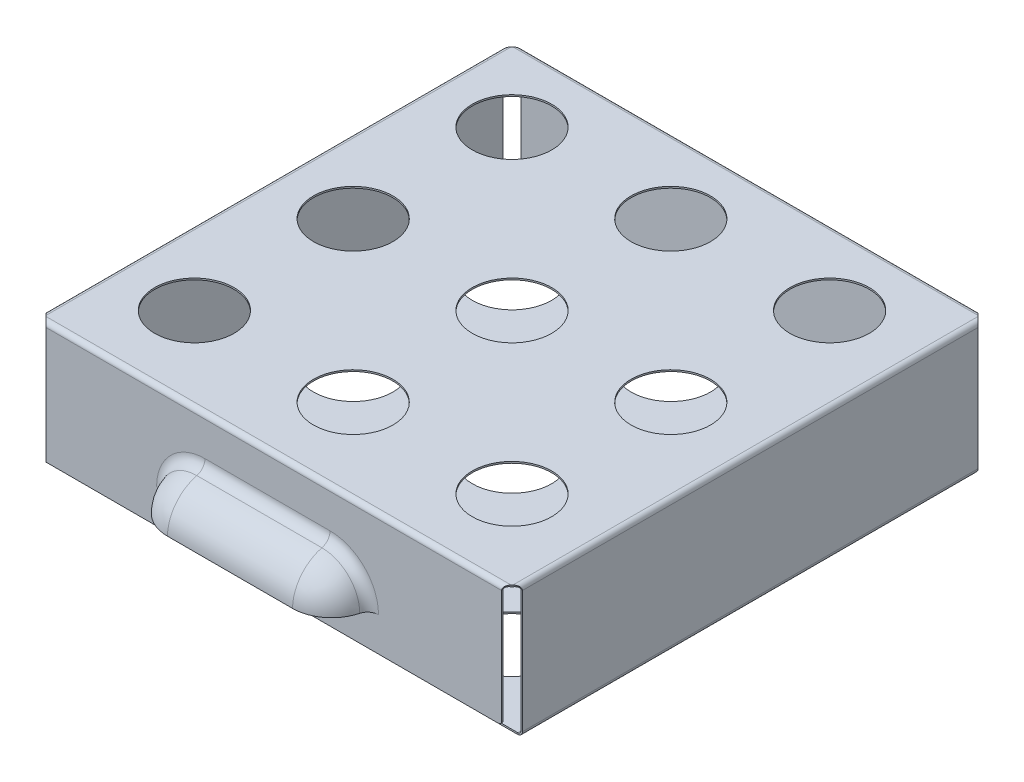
ISO-10303-21;
HEADER;
FILE_DESCRIPTION(('STEP AP214'),'2;1');
FILE_NAME('part.step','',(''),(''),'','','');
FILE_SCHEMA(('AUTOMOTIVE_DESIGN { 1 0 10303 214 1 1 1 1 }'));
ENDSEC;
DATA;
#1=APPLICATION_CONTEXT('core data for automotive mechanical design processes');
#2=APPLICATION_PROTOCOL_DEFINITION('international standard','automotive_design',2000,#1);
#3=PRODUCT_CONTEXT('',#1,'mechanical');
#4=PRODUCT('Part','Part','',(#3));
#5=PRODUCT_RELATED_PRODUCT_CATEGORY('part','',(#4));
#6=PRODUCT_DEFINITION_FORMATION('','',#4);
#7=PRODUCT_DEFINITION_CONTEXT('part definition',#1,'design');
#8=PRODUCT_DEFINITION('design','',#6,#7);
#9=PRODUCT_DEFINITION_SHAPE('','',#8);
#10=(LENGTH_UNIT() NAMED_UNIT(*) SI_UNIT(.MILLI.,.METRE.));
#11=(NAMED_UNIT(*) PLANE_ANGLE_UNIT() SI_UNIT($,.RADIAN.));
#12=(NAMED_UNIT(*) SI_UNIT($,.STERADIAN.) SOLID_ANGLE_UNIT());
#13=UNCERTAINTY_MEASURE_WITH_UNIT(LENGTH_MEASURE(1.E-05),#10,'distance_accuracy_value','');
#14=(GEOMETRIC_REPRESENTATION_CONTEXT(3) GLOBAL_UNCERTAINTY_ASSIGNED_CONTEXT((#13)) GLOBAL_UNIT_ASSIGNED_CONTEXT((#10,
#11,#12)) REPRESENTATION_CONTEXT('',''));
#15=CARTESIAN_POINT('',(0.,0.,0.));
#16=DIRECTION('',(0.,0.,1.));
#17=DIRECTION('',(1.,0.,0.));
#18=AXIS2_PLACEMENT_3D('',#15,#16,#17);
#19=CARTESIAN_POINT('',(-38.1,21.082,38.1));
#20=DIRECTION('',(0.,0.,-1.));
#21=DIRECTION('',(-1.,0.,0.));
#22=AXIS2_PLACEMENT_3D('',#19,#20,#21);
#23=PLANE('',#22);
#24=DIRECTION('',(0.,1.,0.));
#25=VECTOR('',#24,1.);
#26=CARTESIAN_POINT('',(36.4317864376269,21.082,38.1));
#27=LINE('',#26,#25);
#28=CARTESIAN_POINT('',(36.4317864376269,2.1762135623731,38.1));
#29=VERTEX_POINT('',#28);
#30=CARTESIAN_POINT('',(36.4317864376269,20.32,38.1));
#31=VERTEX_POINT('',#30);
#32=EDGE_CURVE('E485',#29,#31,#27,.T.);
#33=ORIENTED_EDGE('',*,*,#32,.T.);
#34=DIRECTION('',(1.,0.,0.));
#35=VECTOR('',#34,1.);
#36=CARTESIAN_POINT('',(-36.4317864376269,20.32,38.1));
#37=LINE('',#36,#35);
#38=CARTESIAN_POINT('',(-36.4317864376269,20.32,38.1));
#39=VERTEX_POINT('',#38);
#40=EDGE_CURVE('E504',#31,#39,#37,.F.);
#41=ORIENTED_EDGE('',*,*,#40,.T.);
#42=DIRECTION('',(0.,-1.,0.));
#43=VECTOR('',#42,1.);
#44=CARTESIAN_POINT('',(-36.4317864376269,21.082,38.1));
#45=LINE('',#44,#43);
#46=CARTESIAN_POINT('',(-36.4317864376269,1.6682135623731,38.1));
#47=VERTEX_POINT('',#46);
#48=EDGE_CURVE('E472',#39,#47,#45,.T.);
#49=ORIENTED_EDGE('',*,*,#48,.T.);
#50=DIRECTION('',(1.,0.,0.));
#51=VECTOR('',#50,1.);
#52=CARTESIAN_POINT('',(-38.1,1.66821356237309,38.1));
#53=LINE('',#52,#51);
#54=CARTESIAN_POINT('',(35.9237864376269,1.66821356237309,38.1));
#55=VERTEX_POINT('',#54);
#56=EDGE_CURVE('E466',#47,#55,#53,.T.);
#57=ORIENTED_EDGE('',*,*,#56,.T.);
#58=CARTESIAN_POINT('',(35.9237864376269,2.17621356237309,38.1));
#59=DIRECTION('',(0.,0.,-1.));
#60=DIRECTION('',(-1.,0.,0.));
#61=AXIS2_PLACEMENT_3D('',#58,#59,#60);
#62=CIRCLE('',#61,0.508);
#63=EDGE_CURVE('E484',#55,#29,#62,.F.);
#64=ORIENTED_EDGE('',*,*,#63,.T.);
#65=EDGE_LOOP('',(#33,#41,#49,#57,#64));
#66=FACE_BOUND('',#65,.T.);
#67=DIRECTION('',(1.,0.,0.));
#68=VECTOR('',#67,1.);
#69=CARTESIAN_POINT('',(-38.0999999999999,7.12112343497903,38.1));
#70=LINE('',#69,#68);
#71=CARTESIAN_POINT('',(-18.7459500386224,7.12112343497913,38.1));
#72=VERTEX_POINT('',#71);
#73=CARTESIAN_POINT('',(-17.7705096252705,7.12112343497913,38.1));
#74=VERTEX_POINT('',#73);
#75=EDGE_CURVE('E389',#72,#74,#70,.T.);
#76=ORIENTED_EDGE('',*,*,#75,.F.);
#77=CARTESIAN_POINT('',(-10.9999833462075,7.12112343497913,38.1));
#78=DIRECTION('',(0.,0.,-1.));
#79=DIRECTION('',(-1.,0.,0.));
#80=AXIS2_PLACEMENT_3D('',#77,#78,#79);
#81=CIRCLE('',#80,7.74596669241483);
#82=CARTESIAN_POINT('',(-10.9999833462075,14.867090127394,38.1));
#83=VERTEX_POINT('',#82);
#84=EDGE_CURVE('E327',#72,#83,#81,.T.);
#85=ORIENTED_EDGE('',*,*,#84,.T.);
#86=DIRECTION('',(1.,0.,0.));
#87=VECTOR('',#86,1.);
#88=CARTESIAN_POINT('',(-10.9999833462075,14.867090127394,38.1));
#89=LINE('',#88,#87);
#90=CARTESIAN_POINT('',(9.00001665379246,14.867090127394,38.1));
#91=VERTEX_POINT('',#90);
#92=EDGE_CURVE('E359',#83,#91,#89,.T.);
#93=ORIENTED_EDGE('',*,*,#92,.T.);
#94=CARTESIAN_POINT('',(9.00001665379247,7.12112343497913,38.1));
#95=DIRECTION('',(0.,0.,-1.));
#96=DIRECTION('',(-1.,0.,0.));
#97=AXIS2_PLACEMENT_3D('',#94,#95,#96);
#98=CIRCLE('',#97,7.74596669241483);
#99=CARTESIAN_POINT('',(16.7459833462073,7.12112343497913,38.1));
#100=VERTEX_POINT('',#99);
#101=EDGE_CURVE('E362',#91,#100,#98,.T.);
#102=ORIENTED_EDGE('',*,*,#101,.T.);
#103=CARTESIAN_POINT('',(15.7705429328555,7.12112343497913,38.1));
#104=VERTEX_POINT('',#103);
#105=EDGE_CURVE('E351',#104,#100,#70,.T.);
#106=ORIENTED_EDGE('',*,*,#105,.F.);
#107=DIRECTION('',(1.,0.,0.));
#108=VECTOR('',#107,1.);
#109=CARTESIAN_POINT('',(-38.1,7.12112343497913,38.1));
#110=LINE('',#109,#108);
#111=EDGE_CURVE('E402',#74,#104,#110,.T.);
#112=ORIENTED_EDGE('',*,*,#111,.F.);
#113=EDGE_LOOP('',(#76,#85,#93,#102,#106,#112));
#114=FACE_BOUND('',#113,.T.);
#115=ADVANCED_FACE('F37',(#66,#114),#23,.F.);
#116=CARTESIAN_POINT('',(-38.1,21.082,37.846));
#117=DIRECTION('',(0.,0.,-1.));
#118=DIRECTION('',(-1.,0.,0.));
#119=AXIS2_PLACEMENT_3D('',#116,#117,#118);
#120=PLANE('',#119);
#121=DIRECTION('',(0.,1.,0.));
#122=VECTOR('',#121,1.);
#123=CARTESIAN_POINT('',(36.4317864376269,21.082,37.846));
#124=LINE('',#123,#122);
#125=CARTESIAN_POINT('',(36.4317864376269,2.1762135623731,37.846));
#126=VERTEX_POINT('',#125);
#127=CARTESIAN_POINT('',(36.4317864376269,20.32,37.846));
#128=VERTEX_POINT('',#127);
#129=EDGE_CURVE('E606',#126,#128,#124,.T.);
#130=ORIENTED_EDGE('',*,*,#129,.F.);
#131=CARTESIAN_POINT('',(35.9237864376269,2.17621356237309,37.846));
#132=DIRECTION('',(0.,0.,-1.));
#133=DIRECTION('',(-1.,0.,0.));
#134=AXIS2_PLACEMENT_3D('',#131,#132,#133);
#135=CIRCLE('',#134,0.508);
#136=CARTESIAN_POINT('',(35.9237864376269,1.66821356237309,37.846));
#137=VERTEX_POINT('',#136);
#138=EDGE_CURVE('E595',#137,#126,#135,.F.);
#139=ORIENTED_EDGE('',*,*,#138,.F.);
#140=DIRECTION('',(-1.,0.,0.));
#141=VECTOR('',#140,1.);
#142=CARTESIAN_POINT('',(-38.1,1.66821356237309,37.846));
#143=LINE('',#142,#141);
#144=CARTESIAN_POINT('',(-36.4317864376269,1.66821356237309,37.846));
#145=VERTEX_POINT('',#144);
#146=EDGE_CURVE('E616',#145,#137,#143,.F.);
#147=ORIENTED_EDGE('',*,*,#146,.F.);
#148=DIRECTION('',(0.,1.,0.));
#149=VECTOR('',#148,1.);
#150=CARTESIAN_POINT('',(-36.4317864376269,21.082,37.846));
#151=LINE('',#150,#149);
#152=CARTESIAN_POINT('',(-36.4317864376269,20.32,37.846));
#153=VERTEX_POINT('',#152);
#154=EDGE_CURVE('E621',#153,#145,#151,.F.);
#155=ORIENTED_EDGE('',*,*,#154,.F.);
#156=DIRECTION('',(-1.,0.,0.));
#157=VECTOR('',#156,1.);
#158=CARTESIAN_POINT('',(-38.1,20.32,37.846));
#159=LINE('',#158,#157);
#160=EDGE_CURVE('E579',#128,#153,#159,.T.);
#161=ORIENTED_EDGE('',*,*,#160,.F.);
#162=EDGE_LOOP('',(#130,#139,#147,#155,#161));
#163=FACE_BOUND('',#162,.T.);
#164=CARTESIAN_POINT('',(-10.9999833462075,7.12112343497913,37.846));
#165=DIRECTION('',(0.,0.,-1.));
#166=DIRECTION('',(-1.,0.,0.));
#167=AXIS2_PLACEMENT_3D('',#164,#165,#166);
#168=CIRCLE('',#167,7.74596669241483);
#169=CARTESIAN_POINT('',(-18.7459500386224,7.12112343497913,37.846));
#170=VERTEX_POINT('',#169);
#171=CARTESIAN_POINT('',(-10.9999833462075,14.867090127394,37.846));
#172=VERTEX_POINT('',#171);
#173=EDGE_CURVE('E395',#170,#172,#168,.T.);
#174=ORIENTED_EDGE('',*,*,#173,.F.);
#175=DIRECTION('',(1.,0.,0.));
#176=VECTOR('',#175,1.);
#177=CARTESIAN_POINT('',(-10.9999833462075,7.12112343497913,37.846));
#178=LINE('',#177,#176);
#179=CARTESIAN_POINT('',(16.7459833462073,7.12112343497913,37.846));
#180=VERTEX_POINT('',#179);
#181=EDGE_CURVE('E60',#170,#180,#178,.T.);
#182=ORIENTED_EDGE('',*,*,#181,.T.);
#183=CARTESIAN_POINT('',(9.00001665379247,7.12112343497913,37.846));
#184=DIRECTION('',(0.,0.,-1.));
#185=DIRECTION('',(-1.,0.,0.));
#186=AXIS2_PLACEMENT_3D('',#183,#184,#185);
#187=CIRCLE('',#186,7.74596669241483);
#188=CARTESIAN_POINT('',(9.00001665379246,14.867090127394,37.846));
#189=VERTEX_POINT('',#188);
#190=EDGE_CURVE('E392',#189,#180,#187,.T.);
#191=ORIENTED_EDGE('',*,*,#190,.F.);
#192=DIRECTION('',(-1.,0.,0.));
#193=VECTOR('',#192,1.);
#194=CARTESIAN_POINT('',(9.00001665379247,14.867090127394,37.846));
#195=LINE('',#194,#193);
#196=EDGE_CURVE('E310',#172,#189,#195,.F.);
#197=ORIENTED_EDGE('',*,*,#196,.F.);
#198=EDGE_LOOP('',(#174,#182,#191,#197));
#199=FACE_BOUND('',#198,.T.);
#200=ADVANCED_FACE('F830',(#163,#199),#120,.T.);
#201=CARTESIAN_POINT('',(0.,0.,36.4317864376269));
#202=DIRECTION('',(0.,0.,-1.));
#203=DIRECTION('',(-1.,0.,0.));
#204=AXIS2_PLACEMENT_3D('',#201,#202,#203);
#205=PLANE('',#204);
#206=DIRECTION('',(0.,-1.,0.));
#207=VECTOR('',#206,1.);
#208=CARTESIAN_POINT('',(37.338,0.,36.4317864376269));
#209=LINE('',#208,#207);
#210=CARTESIAN_POINT('',(37.338,0.253999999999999,36.4317864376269));
#211=VERTEX_POINT('',#210);
#212=CARTESIAN_POINT('',(37.338,0.,36.4317864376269));
#213=VERTEX_POINT('',#212);
#214=EDGE_CURVE('E736',#211,#213,#209,.T.);
#215=ORIENTED_EDGE('',*,*,#214,.F.);
#216=DIRECTION('',(1.,0.,0.));
#217=VECTOR('',#216,1.);
#218=CARTESIAN_POINT('',(0.,0.254,36.4317864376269));
#219=LINE('',#218,#217);
#220=CARTESIAN_POINT('',(-36.4317864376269,0.254,36.4317864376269));
#221=VERTEX_POINT('',#220);
#222=EDGE_CURVE('E619',#211,#221,#219,.F.);
#223=ORIENTED_EDGE('',*,*,#222,.T.);
#224=DIRECTION('',(0.,-1.,0.));
#225=VECTOR('',#224,1.);
#226=CARTESIAN_POINT('',(-36.4317864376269,0.,36.4317864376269));
#227=LINE('',#226,#225);
#228=CARTESIAN_POINT('',(-36.4317864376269,0.,36.4317864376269));
#229=VERTEX_POINT('',#228);
#230=EDGE_CURVE('E734',#221,#229,#227,.T.);
#231=ORIENTED_EDGE('',*,*,#230,.T.);
#232=DIRECTION('',(-1.,0.,0.));
#233=VECTOR('',#232,1.);
#234=CARTESIAN_POINT('',(0.,0.,36.4317864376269));
#235=LINE('',#234,#233);
#236=EDGE_CURVE('E469',#213,#229,#235,.T.);
#237=ORIENTED_EDGE('',*,*,#236,.F.);
#238=EDGE_LOOP('',(#215,#223,#231,#237));
#239=FACE_BOUND('',#238,.T.);
#240=ADVANCED_FACE('F836',(#239),#205,.F.);
#241=CARTESIAN_POINT('',(-36.4317864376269,0.,0.));
#242=DIRECTION('',(1.,0.,0.));
#243=DIRECTION('',(0.,0.,-1.));
#244=AXIS2_PLACEMENT_3D('',#241,#242,#243);
#245=PLANE('',#244);
#246=ORIENTED_EDGE('',*,*,#230,.F.);
#247=DIRECTION('',(0.,0.,1.));
#248=VECTOR('',#247,1.);
#249=CARTESIAN_POINT('',(-36.4317864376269,0.254,0.));
#250=LINE('',#249,#248);
#251=CARTESIAN_POINT('',(-36.4317864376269,0.254,-36.4317864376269));
#252=VERTEX_POINT('',#251);
#253=EDGE_CURVE('E583',#221,#252,#250,.F.);
#254=ORIENTED_EDGE('',*,*,#253,.T.);
#255=DIRECTION('',(0.,-1.,0.));
#256=VECTOR('',#255,1.);
#257=CARTESIAN_POINT('',(-36.4317864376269,0.,-36.4317864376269));
#258=LINE('',#257,#256);
#259=CARTESIAN_POINT('',(-36.4317864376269,0.,-36.4317864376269));
#260=VERTEX_POINT('',#259);
#261=EDGE_CURVE('E732',#252,#260,#258,.T.);
#262=ORIENTED_EDGE('',*,*,#261,.T.);
#263=DIRECTION('',(0.,0.,-1.));
#264=VECTOR('',#263,1.);
#265=CARTESIAN_POINT('',(-36.4317864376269,0.,0.));
#266=LINE('',#265,#264);
#267=EDGE_CURVE('E494',#229,#260,#266,.T.);
#268=ORIENTED_EDGE('',*,*,#267,.F.);
#269=EDGE_LOOP('',(#246,#254,#262,#268));
#270=FACE_BOUND('',#269,.T.);
#271=ADVANCED_FACE('F1069',(#270),#245,.F.);
#272=CARTESIAN_POINT('',(0.,0.,-36.4317864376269));
#273=DIRECTION('',(0.,0.,1.));
#274=DIRECTION('',(1.,0.,0.));
#275=AXIS2_PLACEMENT_3D('',#272,#273,#274);
#276=PLANE('',#275);
#277=ORIENTED_EDGE('',*,*,#261,.F.);
#278=DIRECTION('',(1.,0.,0.));
#279=VECTOR('',#278,1.);
#280=CARTESIAN_POINT('',(0.,0.254,-36.4317864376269));
#281=LINE('',#280,#279);
#282=CARTESIAN_POINT('',(37.338,0.254,-36.4317864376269));
#283=VERTEX_POINT('',#282);
#284=EDGE_CURVE('E653',#252,#283,#281,.T.);
#285=ORIENTED_EDGE('',*,*,#284,.T.);
#286=DIRECTION('',(0.,-1.,0.));
#287=VECTOR('',#286,1.);
#288=CARTESIAN_POINT('',(37.338,0.,-36.4317864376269));
#289=LINE('',#288,#287);
#290=CARTESIAN_POINT('',(37.338,0.,-36.4317864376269));
#291=VERTEX_POINT('',#290);
#292=EDGE_CURVE('E730',#283,#291,#289,.T.);
#293=ORIENTED_EDGE('',*,*,#292,.T.);
#294=DIRECTION('',(1.,0.,0.));
#295=VECTOR('',#294,1.);
#296=CARTESIAN_POINT('',(0.,0.,-36.4317864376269));
#297=LINE('',#296,#295);
#298=EDGE_CURVE('E443',#260,#291,#297,.T.);
#299=ORIENTED_EDGE('',*,*,#298,.F.);
#300=EDGE_LOOP('',(#277,#285,#293,#299));
#301=FACE_BOUND('',#300,.T.);
#302=ADVANCED_FACE('F1065',(#301),#276,.F.);
#303=CARTESIAN_POINT('',(37.338,0.761999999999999,-36.4317864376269));
#304=DIRECTION('',(0.,0.,1.));
#305=DIRECTION('',(1.,0.,0.));
#306=AXIS2_PLACEMENT_3D('',#303,#304,#305);
#307=PLANE('',#306);
#308=ORIENTED_EDGE('',*,*,#292,.F.);
#309=CARTESIAN_POINT('',(37.338,0.761999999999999,-36.4317864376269));
#310=DIRECTION('',(0.,0.,-1.));
#311=DIRECTION('',(-1.,0.,0.));
#312=AXIS2_PLACEMENT_3D('',#309,#310,#311);
#313=CIRCLE('',#312,0.508);
#314=CARTESIAN_POINT('',(37.846,0.761999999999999,-36.4317864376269));
#315=VERTEX_POINT('',#314);
#316=EDGE_CURVE('E439',#283,#315,#313,.F.);
#317=ORIENTED_EDGE('',*,*,#316,.T.);
#318=DIRECTION('',(1.,0.,0.));
#319=VECTOR('',#318,1.);
#320=CARTESIAN_POINT('',(38.1,0.761999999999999,-36.4317864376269));
#321=LINE('',#320,#319);
#322=CARTESIAN_POINT('',(38.1,0.761999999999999,-36.4317864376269));
#323=VERTEX_POINT('',#322);
#324=EDGE_CURVE('E728',#315,#323,#321,.T.);
#325=ORIENTED_EDGE('',*,*,#324,.T.);
#326=CARTESIAN_POINT('',(37.338,0.761999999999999,-36.4317864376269));
#327=DIRECTION('',(0.,0.,-1.));
#328=DIRECTION('',(-1.,0.,0.));
#329=AXIS2_PLACEMENT_3D('',#326,#327,#328);
#330=CIRCLE('',#329,0.762);
#331=EDGE_CURVE('E556',#291,#323,#330,.F.);
#332=ORIENTED_EDGE('',*,*,#331,.F.);
#333=EDGE_LOOP('',(#308,#317,#325,#332));
#334=FACE_BOUND('',#333,.T.);
#335=ADVANCED_FACE('F1061',(#334),#307,.F.);
#336=CARTESIAN_POINT('',(38.1,21.082,-36.4317864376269));
#337=DIRECTION('',(0.,0.,1.));
#338=DIRECTION('',(0.,1.,0.));
#339=AXIS2_PLACEMENT_3D('',#336,#337,#338);
#340=PLANE('',#339);
#341=ORIENTED_EDGE('',*,*,#324,.F.);
#342=DIRECTION('',(0.,1.,0.));
#343=VECTOR('',#342,1.);
#344=CARTESIAN_POINT('',(37.846,21.082,-36.4317864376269));
#345=LINE('',#344,#343);
#346=CARTESIAN_POINT('',(37.846,20.32,-36.4317864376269));
#347=VERTEX_POINT('',#346);
#348=EDGE_CURVE('E660',#315,#347,#345,.T.);
#349=ORIENTED_EDGE('',*,*,#348,.T.);
#350=DIRECTION('',(1.,0.,0.));
#351=VECTOR('',#350,1.);
#352=CARTESIAN_POINT('',(38.1,20.32,-36.4317864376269));
#353=LINE('',#352,#351);
#354=CARTESIAN_POINT('',(38.1,20.32,-36.4317864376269));
#355=VERTEX_POINT('',#354);
#356=EDGE_CURVE('E726',#347,#355,#353,.T.);
#357=ORIENTED_EDGE('',*,*,#356,.T.);
#358=DIRECTION('',(0.,1.,0.));
#359=VECTOR('',#358,1.);
#360=CARTESIAN_POINT('',(38.1,21.082,-36.4317864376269));
#361=LINE('',#360,#359);
#362=EDGE_CURVE('E451',#323,#355,#361,.T.);
#363=ORIENTED_EDGE('',*,*,#362,.F.);
#364=EDGE_LOOP('',(#341,#349,#357,#363));
#365=FACE_BOUND('',#364,.T.);
#366=ADVANCED_FACE('F1052',(#365),#340,.F.);
#367=CARTESIAN_POINT('',(37.846,20.32,-36.4317864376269));
#368=CARTESIAN_POINT('',(37.9306666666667,20.32,-36.4317864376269));
#369=CARTESIAN_POINT('',(38.0153333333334,20.32,-36.4317864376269));
#370=CARTESIAN_POINT('',(38.1,20.32,-36.4317864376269));
#371=CARTESIAN_POINT('',(37.846,21.336,-36.4317864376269));
#372=CARTESIAN_POINT('',(37.9306666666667,21.5053333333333,-36.4317864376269));
#373=CARTESIAN_POINT('',(38.0153333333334,21.6746666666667,-36.4317864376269));
#374=CARTESIAN_POINT('',(38.1,21.844,-36.4317864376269));
#375=CARTESIAN_POINT('',(36.83,21.336,-37.9557864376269));
#376=CARTESIAN_POINT('',(36.7453333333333,21.5053333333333,-37.9557864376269));
#377=CARTESIAN_POINT('',(36.6606666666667,21.6746666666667,-37.9557864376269));
#378=CARTESIAN_POINT('',(36.576,21.844,-37.9557864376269));
#379=CARTESIAN_POINT('',(36.83,20.32,-37.9557864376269));
#380=CARTESIAN_POINT('',(36.7453333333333,20.32,-37.9557864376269));
#381=CARTESIAN_POINT('',(36.6606666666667,20.32,-37.9557864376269));
#382=CARTESIAN_POINT('',(36.576,20.32,-37.9557864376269));
#383=CARTESIAN_POINT('',(36.83,19.304,-37.9557864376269));
#384=CARTESIAN_POINT('',(36.7453333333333,19.1346666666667,-37.9557864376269));
#385=CARTESIAN_POINT('',(36.6606666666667,18.9653333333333,-37.9557864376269));
#386=CARTESIAN_POINT('',(36.576,18.796,-37.9557864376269));
#387=CARTESIAN_POINT('',(37.846,19.304,-36.4317864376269));
#388=CARTESIAN_POINT('',(37.9306666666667,19.1346666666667,-36.4317864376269));
#389=CARTESIAN_POINT('',(38.0153333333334,18.9653333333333,-36.4317864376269));
#390=CARTESIAN_POINT('',(38.1,18.796,-36.4317864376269));
#391=CARTESIAN_POINT('',(37.846,20.32,-36.4317864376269));
#392=CARTESIAN_POINT('',(37.9306666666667,20.32,-36.4317864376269));
#393=CARTESIAN_POINT('',(38.0153333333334,20.32,-36.4317864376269));
#394=CARTESIAN_POINT('',(38.1,20.32,-36.4317864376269));
#395=(BOUNDED_SURFACE() B_SPLINE_SURFACE(3,3,((#367,#368,#369,#370),(#371,#372,#373,#374),(#375,
#376,#377,#378),(#379,#380,#381,#382),(#383,#384,#385,#386),(#387,#388,#389,#390),(#391,#392,
#393,#394)),.UNSPECIFIED.,.T.,.F.,.F.) B_SPLINE_SURFACE_WITH_KNOTS((4,3,4),(4,4),(0.,0.5,1.),
(0.,1.),.UNSPECIFIED.) GEOMETRIC_REPRESENTATION_ITEM() RATIONAL_B_SPLINE_SURFACE(((1.,1.,1.,1.),
(0.333333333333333,0.333333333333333,0.333333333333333,0.333333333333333),(0.333333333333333,
0.333333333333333,0.333333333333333,0.333333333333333),(1.,1.,1.,1.),(0.333333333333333,
0.333333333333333,0.333333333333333,0.333333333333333),(0.333333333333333,0.333333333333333,
0.333333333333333,0.333333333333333),(1.,1.,1.,1.))) REPRESENTATION_ITEM('') SURFACE());
#396=CARTESIAN_POINT('',(37.338,20.32,-37.1937864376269));
#397=DIRECTION('',(-0.832050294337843,0.,0.554700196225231));
#398=DIRECTION('',(0.554700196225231,0.,0.832050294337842));
#399=AXIS2_PLACEMENT_3D('',#396,#397,#398);
#400=ELLIPSE('',#399,0.915810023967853,0.508);
#401=CARTESIAN_POINT('',(37.338,20.828,-37.1937864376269));
#402=VERTEX_POINT('',#401);
#403=EDGE_CURVE('E601',#347,#402,#400,.T.);
#404=DIRECTION('',(0.,1.,0.));
#405=VECTOR('',#404,1.);
#406=CARTESIAN_POINT('',(37.338,21.082,-37.1937864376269));
#407=LINE('',#406,#405);
#408=CARTESIAN_POINT('',(37.338,21.082,-37.1937864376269));
#409=VERTEX_POINT('',#408);
#410=EDGE_CURVE('E724',#402,#409,#407,.T.);
#411=CARTESIAN_POINT('',(37.338,20.32,-37.1937864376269));
#412=DIRECTION('',(-0.707106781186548,0.,0.707106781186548));
#413=DIRECTION('',(0.707106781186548,0.,0.707106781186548));
#414=AXIS2_PLACEMENT_3D('',#411,#412,#413);
#415=ELLIPSE('',#414,1.0776307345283,0.762);
#416=EDGE_CURVE('E544',#355,#409,#415,.T.);
#417=ORIENTED_EDGE('',*,*,#356,.F.);
#418=ORIENTED_EDGE('',*,*,#403,.T.);
#419=ORIENTED_EDGE('',*,*,#410,.T.);
#420=ORIENTED_EDGE('',*,*,#416,.F.);
#421=EDGE_LOOP('',(#417,#418,#419,#420));
#422=FACE_BOUND('',#421,.T.);
#423=ADVANCED_FACE('F1046',(#422),#395,.T.);
#424=CARTESIAN_POINT('',(37.2658932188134,21.082,-37.2658932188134));
#425=DIRECTION('',(-0.707106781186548,0.,0.707106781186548));
#426=DIRECTION('',(0.707106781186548,0.,0.707106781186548));
#427=AXIS2_PLACEMENT_3D('',#424,#425,#426);
#428=PLANE('',#427);
#429=ORIENTED_EDGE('',*,*,#410,.F.);
#430=DIRECTION('',(0.707106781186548,0.,0.707106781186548));
#431=VECTOR('',#430,1.);
#432=CARTESIAN_POINT('',(37.2658932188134,20.828,-37.2658932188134));
#433=LINE('',#432,#431);
#434=CARTESIAN_POINT('',(37.1937864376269,20.828,-37.338));
#435=VERTEX_POINT('',#434);
#436=EDGE_CURVE('E642',#402,#435,#433,.F.);
#437=ORIENTED_EDGE('',*,*,#436,.T.);
#438=DIRECTION('',(0.,1.,0.));
#439=VECTOR('',#438,1.);
#440=CARTESIAN_POINT('',(37.1937864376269,21.082,-37.338));
#441=LINE('',#440,#439);
#442=CARTESIAN_POINT('',(37.1937864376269,21.082,-37.338));
#443=VERTEX_POINT('',#442);
#444=EDGE_CURVE('E722',#435,#443,#441,.T.);
#445=ORIENTED_EDGE('',*,*,#444,.T.);
#446=DIRECTION('',(0.707106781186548,0.,0.707106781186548));
#447=VECTOR('',#446,1.);
#448=CARTESIAN_POINT('',(37.2658932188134,21.082,-37.2658932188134));
#449=LINE('',#448,#447);
#450=EDGE_CURVE('E454',#409,#443,#449,.F.);
#451=ORIENTED_EDGE('',*,*,#450,.F.);
#452=EDGE_LOOP('',(#429,#437,#445,#451));
#453=FACE_BOUND('',#452,.T.);
#454=ADVANCED_FACE('F1037',(#453),#428,.F.);
#455=CARTESIAN_POINT('',(37.9557864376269,20.32,-36.83));
#456=CARTESIAN_POINT('',(37.9557864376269,20.32,-36.7453333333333));
#457=CARTESIAN_POINT('',(37.9557864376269,20.32,-36.6606666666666));
#458=CARTESIAN_POINT('',(37.9557864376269,20.32,-36.576));
#459=CARTESIAN_POINT('',(37.9557864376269,21.336,-36.83));
#460=CARTESIAN_POINT('',(37.9557864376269,21.5053333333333,-36.7453333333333));
#461=CARTESIAN_POINT('',(37.9557864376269,21.6746666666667,-36.6606666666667));
#462=CARTESIAN_POINT('',(37.9557864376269,21.844,-36.576));
#463=CARTESIAN_POINT('',(36.4317864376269,21.336,-37.846));
#464=CARTESIAN_POINT('',(36.4317864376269,21.5053333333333,-37.9306666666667));
#465=CARTESIAN_POINT('',(36.4317864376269,21.6746666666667,-38.0153333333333));
#466=CARTESIAN_POINT('',(36.4317864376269,21.844,-38.1));
#467=CARTESIAN_POINT('',(36.4317864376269,20.32,-37.846));
#468=CARTESIAN_POINT('',(36.4317864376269,20.32,-37.9306666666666));
#469=CARTESIAN_POINT('',(36.4317864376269,20.32,-38.0153333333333));
#470=CARTESIAN_POINT('',(36.4317864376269,20.32,-38.1));
#471=CARTESIAN_POINT('',(36.4317864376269,19.304,-37.846));
#472=CARTESIAN_POINT('',(36.4317864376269,19.1346666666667,-37.9306666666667));
#473=CARTESIAN_POINT('',(36.4317864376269,18.9653333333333,-38.0153333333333));
#474=CARTESIAN_POINT('',(36.4317864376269,18.796,-38.1));
#475=CARTESIAN_POINT('',(37.9557864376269,19.304,-36.83));
#476=CARTESIAN_POINT('',(37.9557864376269,19.1346666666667,-36.7453333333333));
#477=CARTESIAN_POINT('',(37.9557864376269,18.9653333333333,-36.6606666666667));
#478=CARTESIAN_POINT('',(37.9557864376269,18.796,-36.576));
#479=CARTESIAN_POINT('',(37.9557864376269,20.32,-36.83));
#480=CARTESIAN_POINT('',(37.9557864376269,20.32,-36.7453333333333));
#481=CARTESIAN_POINT('',(37.9557864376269,20.32,-36.6606666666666));
#482=CARTESIAN_POINT('',(37.9557864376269,20.32,-36.576));
#483=(BOUNDED_SURFACE() B_SPLINE_SURFACE(3,3,((#455,#456,#457,#458),(#459,#460,#461,#462),(#463,
#464,#465,#466),(#467,#468,#469,#470),(#471,#472,#473,#474),(#475,#476,#477,#478),(#479,#480,
#481,#482)),.UNSPECIFIED.,.T.,.F.,.F.) B_SPLINE_SURFACE_WITH_KNOTS((4,3,4),(4,4),(0.,0.5,1.),
(0.,1.),.UNSPECIFIED.) GEOMETRIC_REPRESENTATION_ITEM() RATIONAL_B_SPLINE_SURFACE(((1.,1.,1.,1.),
(0.333333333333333,0.333333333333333,0.333333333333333,0.333333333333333),(0.333333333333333,
0.333333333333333,0.333333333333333,0.333333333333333),(1.,1.,1.,1.),(0.333333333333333,
0.333333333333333,0.333333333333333,0.333333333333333),(0.333333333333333,0.333333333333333,
0.333333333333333,0.333333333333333),(1.,1.,1.,1.))) REPRESENTATION_ITEM('') SURFACE());
#484=CARTESIAN_POINT('',(37.1937864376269,20.32,-37.338));
#485=DIRECTION('',(-0.554700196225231,0.,0.832050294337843));
#486=DIRECTION('',(0.832050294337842,0.,0.554700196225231));
#487=AXIS2_PLACEMENT_3D('',#484,#485,#486);
#488=ELLIPSE('',#487,0.915810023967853,0.508);
#489=CARTESIAN_POINT('',(36.4317864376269,20.32,-37.846));
#490=VERTEX_POINT('',#489);
#491=EDGE_CURVE('E633',#435,#490,#488,.T.);
#492=DIRECTION('',(0.,0.,-1.));
#493=VECTOR('',#492,1.);
#494=CARTESIAN_POINT('',(36.4317864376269,20.32,-38.1));
#495=LINE('',#494,#493);
#496=CARTESIAN_POINT('',(36.4317864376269,20.32,-38.1));
#497=VERTEX_POINT('',#496);
#498=EDGE_CURVE('E720',#490,#497,#495,.T.);
#499=CARTESIAN_POINT('',(37.1937864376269,20.32,-37.338));
#500=DIRECTION('',(-0.707106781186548,0.,0.707106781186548));
#501=DIRECTION('',(0.707106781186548,0.,0.707106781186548));
#502=AXIS2_PLACEMENT_3D('',#499,#500,#501);
#503=ELLIPSE('',#502,1.0776307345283,0.762);
#504=EDGE_CURVE('E523',#443,#497,#503,.T.);
#505=ORIENTED_EDGE('',*,*,#444,.F.);
#506=ORIENTED_EDGE('',*,*,#491,.T.);
#507=ORIENTED_EDGE('',*,*,#498,.T.);
#508=ORIENTED_EDGE('',*,*,#504,.F.);
#509=EDGE_LOOP('',(#505,#506,#507,#508));
#510=FACE_BOUND('',#509,.T.);
#511=ADVANCED_FACE('F1031',(#510),#483,.T.);
#512=CARTESIAN_POINT('',(36.4317864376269,21.082,-38.1));
#513=DIRECTION('',(-1.,0.,0.));
#514=DIRECTION('',(0.,-1.,0.));
#515=AXIS2_PLACEMENT_3D('',#512,#513,#514);
#516=PLANE('',#515);
#517=ORIENTED_EDGE('',*,*,#498,.F.);
#518=DIRECTION('',(0.,1.,0.));
#519=VECTOR('',#518,1.);
#520=CARTESIAN_POINT('',(36.4317864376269,21.082,-37.846));
#521=LINE('',#520,#519);
#522=CARTESIAN_POINT('',(36.4317864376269,2.1762135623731,-37.846));
#523=VERTEX_POINT('',#522);
#524=EDGE_CURVE('E657',#490,#523,#521,.F.);
#525=ORIENTED_EDGE('',*,*,#524,.T.);
#526=DIRECTION('',(0.,0.,-1.));
#527=VECTOR('',#526,1.);
#528=CARTESIAN_POINT('',(36.4317864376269,2.1762135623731,-38.1));
#529=LINE('',#528,#527);
#530=CARTESIAN_POINT('',(36.4317864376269,2.1762135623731,-38.1));
#531=VERTEX_POINT('',#530);
#532=EDGE_CURVE('E718',#523,#531,#529,.T.);
#533=ORIENTED_EDGE('',*,*,#532,.T.);
#534=DIRECTION('',(0.,-1.,0.));
#535=VECTOR('',#534,1.);
#536=CARTESIAN_POINT('',(36.4317864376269,21.082,-38.1));
#537=LINE('',#536,#535);
#538=EDGE_CURVE('E448',#497,#531,#537,.T.);
#539=ORIENTED_EDGE('',*,*,#538,.F.);
#540=EDGE_LOOP('',(#517,#525,#533,#539));
#541=FACE_BOUND('',#540,.T.);
#542=ADVANCED_FACE('F1027',(#541),#516,.F.);
#543=CARTESIAN_POINT('',(35.9237864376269,2.17621356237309,-38.1));
#544=DIRECTION('',(0.,0.,1.));
#545=DIRECTION('',(1.,0.,0.));
#546=AXIS2_PLACEMENT_3D('',#543,#544,#545);
#547=CYLINDRICAL_SURFACE('',#546,0.508);
#548=ORIENTED_EDGE('',*,*,#532,.F.);
#549=CARTESIAN_POINT('',(35.9237864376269,2.17621356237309,-37.846));
#550=DIRECTION('',(0.,0.,1.));
#551=DIRECTION('',(1.,0.,0.));
#552=AXIS2_PLACEMENT_3D('',#549,#550,#551);
#553=CIRCLE('',#552,0.508);
#554=CARTESIAN_POINT('',(35.9237864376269,1.66821356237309,-37.846));
#555=VERTEX_POINT('',#554);
#556=EDGE_CURVE('E654',#523,#555,#553,.F.);
#557=ORIENTED_EDGE('',*,*,#556,.T.);
#558=DIRECTION('',(0.,0.,-1.));
#559=VECTOR('',#558,1.);
#560=CARTESIAN_POINT('',(35.9237864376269,1.66821356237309,-38.1));
#561=LINE('',#560,#559);
#562=CARTESIAN_POINT('',(35.9237864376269,1.66821356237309,-38.1));
#563=VERTEX_POINT('',#562);
#564=EDGE_CURVE('E716',#555,#563,#561,.T.);
#565=ORIENTED_EDGE('',*,*,#564,.T.);
#566=CARTESIAN_POINT('',(35.9237864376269,2.17621356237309,-38.1));
#567=DIRECTION('',(0.,0.,1.));
#568=DIRECTION('',(1.,0.,0.));
#569=AXIS2_PLACEMENT_3D('',#566,#567,#568);
#570=CIRCLE('',#569,0.508);
#571=EDGE_CURVE('E447',#531,#563,#570,.F.);
#572=ORIENTED_EDGE('',*,*,#571,.F.);
#573=EDGE_LOOP('',(#548,#557,#565,#572));
#574=FACE_BOUND('',#573,.T.);
#575=ADVANCED_FACE('F1023',(#574),#547,.T.);
#576=CARTESIAN_POINT('',(-38.1,1.66821356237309,-38.1));
#577=DIRECTION('',(0.,1.,0.));
#578=DIRECTION('',(-1.,0.,0.));
#579=AXIS2_PLACEMENT_3D('',#576,#577,#578);
#580=PLANE('',#579);
#581=ORIENTED_EDGE('',*,*,#564,.F.);
#582=DIRECTION('',(1.,0.,0.));
#583=VECTOR('',#582,1.);
#584=CARTESIAN_POINT('',(-38.1,1.66821356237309,-37.846));
#585=LINE('',#584,#583);
#586=CARTESIAN_POINT('',(-36.4317864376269,1.66821356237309,-37.846));
#587=VERTEX_POINT('',#586);
#588=EDGE_CURVE('E627',#555,#587,#585,.F.);
#589=ORIENTED_EDGE('',*,*,#588,.T.);
#590=DIRECTION('',(0.,0.,-1.));
#591=VECTOR('',#590,1.);
#592=CARTESIAN_POINT('',(-36.4317864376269,1.66821356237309,-38.1));
#593=LINE('',#592,#591);
#594=CARTESIAN_POINT('',(-36.4317864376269,1.66821356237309,-38.1));
#595=VERTEX_POINT('',#594);
#596=EDGE_CURVE('E714',#587,#595,#593,.T.);
#597=ORIENTED_EDGE('',*,*,#596,.T.);
#598=DIRECTION('',(-1.,0.,0.));
#599=VECTOR('',#598,1.);
#600=CARTESIAN_POINT('',(-38.1,1.66821356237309,-38.1));
#601=LINE('',#600,#599);
#602=EDGE_CURVE('E440',#563,#595,#601,.T.);
#603=ORIENTED_EDGE('',*,*,#602,.F.);
#604=EDGE_LOOP('',(#581,#589,#597,#603));
#605=FACE_BOUND('',#604,.T.);
#606=ADVANCED_FACE('F1019',(#605),#580,.F.);
#607=CARTESIAN_POINT('',(-36.4317864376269,21.082,-38.1));
#608=DIRECTION('',(1.,0.,0.));
#609=DIRECTION('',(0.,1.,0.));
#610=AXIS2_PLACEMENT_3D('',#607,#608,#609);
#611=PLANE('',#610);
#612=ORIENTED_EDGE('',*,*,#596,.F.);
#613=DIRECTION('',(0.,1.,0.));
#614=VECTOR('',#613,1.);
#615=CARTESIAN_POINT('',(-36.4317864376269,21.082,-37.846));
#616=LINE('',#615,#614);
#617=CARTESIAN_POINT('',(-36.4317864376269,20.32,-37.846));
#618=VERTEX_POINT('',#617);
#619=EDGE_CURVE('E641',#587,#618,#616,.T.);
#620=ORIENTED_EDGE('',*,*,#619,.T.);
#621=DIRECTION('',(0.,0.,-1.));
#622=VECTOR('',#621,1.);
#623=CARTESIAN_POINT('',(-36.4317864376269,20.32,-38.1));
#624=LINE('',#623,#622);
#625=CARTESIAN_POINT('',(-36.4317864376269,20.32,-38.1));
#626=VERTEX_POINT('',#625);
#627=EDGE_CURVE('E712',#618,#626,#624,.T.);
#628=ORIENTED_EDGE('',*,*,#627,.T.);
#629=DIRECTION('',(0.,1.,0.));
#630=VECTOR('',#629,1.);
#631=CARTESIAN_POINT('',(-36.4317864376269,21.082,-38.1));
#632=LINE('',#631,#630);
#633=EDGE_CURVE('E460',#595,#626,#632,.T.);
#634=ORIENTED_EDGE('',*,*,#633,.F.);
#635=EDGE_LOOP('',(#612,#620,#628,#634));
#636=FACE_BOUND('',#635,.T.);
#637=ADVANCED_FACE('F1010',(#636),#611,.F.);
#638=CARTESIAN_POINT('',(-36.4317864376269,20.32,-37.846));
#639=CARTESIAN_POINT('',(-36.4317864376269,20.32,-37.9306666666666));
#640=CARTESIAN_POINT('',(-36.4317864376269,20.32,-38.0153333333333));
#641=CARTESIAN_POINT('',(-36.4317864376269,20.32,-38.1));
#642=CARTESIAN_POINT('',(-36.4317864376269,21.336,-37.846));
#643=CARTESIAN_POINT('',(-36.4317864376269,21.5053333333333,-37.9306666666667));
#644=CARTESIAN_POINT('',(-36.4317864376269,21.6746666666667,-38.0153333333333));
#645=CARTESIAN_POINT('',(-36.4317864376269,21.844,-38.1));
#646=CARTESIAN_POINT('',(-37.9557864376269,21.336,-36.83));
#647=CARTESIAN_POINT('',(-37.9557864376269,21.5053333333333,-36.7453333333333));
#648=CARTESIAN_POINT('',(-37.9557864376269,21.6746666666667,-36.6606666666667));
#649=CARTESIAN_POINT('',(-37.9557864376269,21.844,-36.576));
#650=CARTESIAN_POINT('',(-37.9557864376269,20.32,-36.83));
#651=CARTESIAN_POINT('',(-37.9557864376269,20.32,-36.7453333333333));
#652=CARTESIAN_POINT('',(-37.9557864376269,20.32,-36.6606666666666));
#653=CARTESIAN_POINT('',(-37.9557864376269,20.32,-36.576));
#654=CARTESIAN_POINT('',(-37.9557864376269,19.304,-36.83));
#655=CARTESIAN_POINT('',(-37.9557864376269,19.1346666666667,-36.7453333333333));
#656=CARTESIAN_POINT('',(-37.9557864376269,18.9653333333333,-36.6606666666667));
#657=CARTESIAN_POINT('',(-37.9557864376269,18.796,-36.576));
#658=CARTESIAN_POINT('',(-36.4317864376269,19.304,-37.846));
#659=CARTESIAN_POINT('',(-36.4317864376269,19.1346666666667,-37.9306666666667));
#660=CARTESIAN_POINT('',(-36.4317864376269,18.9653333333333,-38.0153333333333));
#661=CARTESIAN_POINT('',(-36.4317864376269,18.796,-38.1));
#662=CARTESIAN_POINT('',(-36.4317864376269,20.32,-37.846));
#663=CARTESIAN_POINT('',(-36.4317864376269,20.32,-37.9306666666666));
#664=CARTESIAN_POINT('',(-36.4317864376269,20.32,-38.0153333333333));
#665=CARTESIAN_POINT('',(-36.4317864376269,20.32,-38.1));
#666=(BOUNDED_SURFACE() B_SPLINE_SURFACE(3,3,((#638,#639,#640,#641),(#642,#643,#644,#645),(#646,
#647,#648,#649),(#650,#651,#652,#653),(#654,#655,#656,#657),(#658,#659,#660,#661),(#662,#663,
#664,#665)),.UNSPECIFIED.,.T.,.F.,.F.) B_SPLINE_SURFACE_WITH_KNOTS((4,3,4),(4,4),(0.,0.5,1.),
(0.,1.),.UNSPECIFIED.) GEOMETRIC_REPRESENTATION_ITEM() RATIONAL_B_SPLINE_SURFACE(((1.,1.,1.,1.),
(0.333333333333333,0.333333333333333,0.333333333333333,0.333333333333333),(0.333333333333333,
0.333333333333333,0.333333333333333,0.333333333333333),(1.,1.,1.,1.),(0.333333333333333,
0.333333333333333,0.333333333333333,0.333333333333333),(0.333333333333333,0.333333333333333,
0.333333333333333,0.333333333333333),(1.,1.,1.,1.))) REPRESENTATION_ITEM('') SURFACE());
#667=CARTESIAN_POINT('',(-37.1937864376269,20.32,-37.338));
#668=DIRECTION('',(0.554700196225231,0.,0.832050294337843));
#669=DIRECTION('',(0.832050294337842,0.,-0.554700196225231));
#670=AXIS2_PLACEMENT_3D('',#667,#668,#669);
#671=ELLIPSE('',#670,0.915810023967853,0.508);
#672=CARTESIAN_POINT('',(-37.1937864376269,20.828,-37.338));
#673=VERTEX_POINT('',#672);
#674=EDGE_CURVE('E600',#618,#673,#671,.T.);
#675=DIRECTION('',(0.,1.,0.));
#676=VECTOR('',#675,1.);
#677=CARTESIAN_POINT('',(-37.1937864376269,21.082,-37.338));
#678=LINE('',#677,#676);
#679=CARTESIAN_POINT('',(-37.1937864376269,21.082,-37.338));
#680=VERTEX_POINT('',#679);
#681=EDGE_CURVE('E710',#673,#680,#678,.T.);
#682=CARTESIAN_POINT('',(-37.1937864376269,20.32,-37.338));
#683=DIRECTION('',(0.707106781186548,0.,0.707106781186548));
#684=DIRECTION('',(0.707106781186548,0.,-0.707106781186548));
#685=AXIS2_PLACEMENT_3D('',#682,#683,#684);
#686=ELLIPSE('',#685,1.0776307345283,0.762);
#687=EDGE_CURVE('E532',#626,#680,#686,.T.);
#688=ORIENTED_EDGE('',*,*,#627,.F.);
#689=ORIENTED_EDGE('',*,*,#674,.T.);
#690=ORIENTED_EDGE('',*,*,#681,.T.);
#691=ORIENTED_EDGE('',*,*,#687,.F.);
#692=EDGE_LOOP('',(#688,#689,#690,#691));
#693=FACE_BOUND('',#692,.T.);
#694=ADVANCED_FACE('F1004',(#693),#666,.T.);
#695=CARTESIAN_POINT('',(-37.2658932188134,21.082,-37.2658932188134));
#696=DIRECTION('',(0.707106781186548,0.,0.707106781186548));
#697=DIRECTION('',(0.707106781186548,0.,-0.707106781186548));
#698=AXIS2_PLACEMENT_3D('',#695,#696,#697);
#699=PLANE('',#698);
#700=ORIENTED_EDGE('',*,*,#681,.F.);
#701=DIRECTION('',(0.707106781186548,0.,-0.707106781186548));
#702=VECTOR('',#701,1.);
#703=CARTESIAN_POINT('',(-37.2658932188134,20.828,-37.2658932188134));
#704=LINE('',#703,#702);
#705=CARTESIAN_POINT('',(-37.338,20.828,-37.1937864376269));
#706=VERTEX_POINT('',#705);
#707=EDGE_CURVE('E620',#673,#706,#704,.F.);
#708=ORIENTED_EDGE('',*,*,#707,.T.);
#709=DIRECTION('',(0.,1.,0.));
#710=VECTOR('',#709,1.);
#711=CARTESIAN_POINT('',(-37.338,21.082,-37.1937864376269));
#712=LINE('',#711,#710);
#713=CARTESIAN_POINT('',(-37.338,21.082,-37.1937864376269));
#714=VERTEX_POINT('',#713);
#715=EDGE_CURVE('E708',#706,#714,#712,.T.);
#716=ORIENTED_EDGE('',*,*,#715,.T.);
#717=DIRECTION('',(0.707106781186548,0.,-0.707106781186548));
#718=VECTOR('',#717,1.);
#719=CARTESIAN_POINT('',(-37.2658932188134,21.082,-37.2658932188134));
#720=LINE('',#719,#718);
#721=EDGE_CURVE('E463',#680,#714,#720,.F.);
#722=ORIENTED_EDGE('',*,*,#721,.F.);
#723=EDGE_LOOP('',(#700,#708,#716,#722));
#724=FACE_BOUND('',#723,.T.);
#725=ADVANCED_FACE('F995',(#724),#699,.F.);
#726=CARTESIAN_POINT('',(-36.83,20.32,-37.9557864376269));
#727=CARTESIAN_POINT('',(-36.7453333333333,20.32,-37.9557864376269));
#728=CARTESIAN_POINT('',(-36.6606666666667,20.32,-37.9557864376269));
#729=CARTESIAN_POINT('',(-36.576,20.32,-37.9557864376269));
#730=CARTESIAN_POINT('',(-36.83,21.336,-37.9557864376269));
#731=CARTESIAN_POINT('',(-36.7453333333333,21.5053333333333,-37.9557864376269));
#732=CARTESIAN_POINT('',(-36.6606666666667,21.6746666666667,-37.9557864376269));
#733=CARTESIAN_POINT('',(-36.576,21.844,-37.9557864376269));
#734=CARTESIAN_POINT('',(-37.846,21.336,-36.4317864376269));
#735=CARTESIAN_POINT('',(-37.9306666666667,21.5053333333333,-36.4317864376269));
#736=CARTESIAN_POINT('',(-38.0153333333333,21.6746666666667,-36.4317864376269));
#737=CARTESIAN_POINT('',(-38.1,21.844,-36.4317864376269));
#738=CARTESIAN_POINT('',(-37.846,20.32,-36.4317864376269));
#739=CARTESIAN_POINT('',(-37.9306666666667,20.32,-36.4317864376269));
#740=CARTESIAN_POINT('',(-38.0153333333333,20.32,-36.4317864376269));
#741=CARTESIAN_POINT('',(-38.1,20.32,-36.4317864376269));
#742=CARTESIAN_POINT('',(-37.846,19.304,-36.4317864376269));
#743=CARTESIAN_POINT('',(-37.9306666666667,19.1346666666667,-36.4317864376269));
#744=CARTESIAN_POINT('',(-38.0153333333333,18.9653333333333,-36.4317864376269));
#745=CARTESIAN_POINT('',(-38.1,18.796,-36.4317864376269));
#746=CARTESIAN_POINT('',(-36.83,19.304,-37.9557864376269));
#747=CARTESIAN_POINT('',(-36.7453333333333,19.1346666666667,-37.9557864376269));
#748=CARTESIAN_POINT('',(-36.6606666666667,18.9653333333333,-37.9557864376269));
#749=CARTESIAN_POINT('',(-36.576,18.796,-37.9557864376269));
#750=CARTESIAN_POINT('',(-36.83,20.32,-37.9557864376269));
#751=CARTESIAN_POINT('',(-36.7453333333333,20.32,-37.9557864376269));
#752=CARTESIAN_POINT('',(-36.6606666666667,20.32,-37.9557864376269));
#753=CARTESIAN_POINT('',(-36.576,20.32,-37.9557864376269));
#754=(BOUNDED_SURFACE() B_SPLINE_SURFACE(3,3,((#726,#727,#728,#729),(#730,#731,#732,#733),(#734,
#735,#736,#737),(#738,#739,#740,#741),(#742,#743,#744,#745),(#746,#747,#748,#749),(#750,#751,
#752,#753)),.UNSPECIFIED.,.T.,.F.,.F.) B_SPLINE_SURFACE_WITH_KNOTS((4,3,4),(4,4),(0.,0.5,1.),
(0.,1.),.UNSPECIFIED.) GEOMETRIC_REPRESENTATION_ITEM() RATIONAL_B_SPLINE_SURFACE(((1.,1.,1.,1.),
(0.333333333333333,0.333333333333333,0.333333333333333,0.333333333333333),(0.333333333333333,
0.333333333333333,0.333333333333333,0.333333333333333),(1.,1.,1.,1.),(0.333333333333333,
0.333333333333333,0.333333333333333,0.333333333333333),(0.333333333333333,0.333333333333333,
0.333333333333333,0.333333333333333),(1.,1.,1.,1.))) REPRESENTATION_ITEM('') SURFACE());
#755=CARTESIAN_POINT('',(-37.338,20.32,-37.1937864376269));
#756=DIRECTION('',(0.832050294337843,0.,0.554700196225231));
#757=DIRECTION('',(0.554700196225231,0.,-0.832050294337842));
#758=AXIS2_PLACEMENT_3D('',#755,#756,#757);
#759=ELLIPSE('',#758,0.915810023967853,0.508);
#760=CARTESIAN_POINT('',(-37.846,20.32,-36.4317864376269));
#761=VERTEX_POINT('',#760);
#762=EDGE_CURVE('E611',#706,#761,#759,.T.);
#763=DIRECTION('',(-1.,0.,0.));
#764=VECTOR('',#763,1.);
#765=CARTESIAN_POINT('',(-38.1,20.32,-36.4317864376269));
#766=LINE('',#765,#764);
#767=CARTESIAN_POINT('',(-38.1,20.32,-36.4317864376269));
#768=VERTEX_POINT('',#767);
#769=EDGE_CURVE('E706',#761,#768,#766,.T.);
#770=CARTESIAN_POINT('',(-37.338,20.32,-37.1937864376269));
#771=DIRECTION('',(0.707106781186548,0.,0.707106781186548));
#772=DIRECTION('',(0.707106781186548,0.,-0.707106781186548));
#773=AXIS2_PLACEMENT_3D('',#770,#771,#772);
#774=ELLIPSE('',#773,1.0776307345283,0.762);
#775=EDGE_CURVE('E511',#714,#768,#774,.T.);
#776=ORIENTED_EDGE('',*,*,#715,.F.);
#777=ORIENTED_EDGE('',*,*,#762,.T.);
#778=ORIENTED_EDGE('',*,*,#769,.T.);
#779=ORIENTED_EDGE('',*,*,#775,.F.);
#780=EDGE_LOOP('',(#776,#777,#778,#779));
#781=FACE_BOUND('',#780,.T.);
#782=ADVANCED_FACE('F989',(#781),#754,.T.);
#783=CARTESIAN_POINT('',(-38.1,21.082,-36.4317864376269));
#784=DIRECTION('',(0.,0.,1.));
#785=DIRECTION('',(0.,-1.,0.));
#786=AXIS2_PLACEMENT_3D('',#783,#784,#785);
#787=PLANE('',#786);
#788=ORIENTED_EDGE('',*,*,#769,.F.);
#789=DIRECTION('',(0.,1.,0.));
#790=VECTOR('',#789,1.);
#791=CARTESIAN_POINT('',(-37.846,21.082,-36.4317864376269));
#792=LINE('',#791,#790);
#793=CARTESIAN_POINT('',(-37.846,1.66821356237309,-36.4317864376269));
#794=VERTEX_POINT('',#793);
#795=EDGE_CURVE('E638',#761,#794,#792,.F.);
#796=ORIENTED_EDGE('',*,*,#795,.T.);
#797=DIRECTION('',(-1.,0.,0.));
#798=VECTOR('',#797,1.);
#799=CARTESIAN_POINT('',(-38.1,1.6682135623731,-36.4317864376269));
#800=LINE('',#799,#798);
#801=CARTESIAN_POINT('',(-38.1,1.6682135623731,-36.4317864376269));
#802=VERTEX_POINT('',#801);
#803=EDGE_CURVE('E704',#794,#802,#800,.T.);
#804=ORIENTED_EDGE('',*,*,#803,.T.);
#805=DIRECTION('',(0.,-1.,0.));
#806=VECTOR('',#805,1.);
#807=CARTESIAN_POINT('',(-38.1,21.082,-36.4317864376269));
#808=LINE('',#807,#806);
#809=EDGE_CURVE('E457',#768,#802,#808,.T.);
#810=ORIENTED_EDGE('',*,*,#809,.F.);
#811=EDGE_LOOP('',(#788,#796,#804,#810));
#812=FACE_BOUND('',#811,.T.);
#813=ADVANCED_FACE('F985',(#812),#787,.F.);
#814=CARTESIAN_POINT('',(-38.1,1.66821356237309,-38.1));
#815=DIRECTION('',(0.,1.,0.));
#816=DIRECTION('',(0.,0.,1.));
#817=AXIS2_PLACEMENT_3D('',#814,#815,#816);
#818=PLANE('',#817);
#819=ORIENTED_EDGE('',*,*,#803,.F.);
#820=DIRECTION('',(0.,0.,-1.));
#821=VECTOR('',#820,1.);
#822=CARTESIAN_POINT('',(-37.846,1.66821356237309,-38.1));
#823=LINE('',#822,#821);
#824=CARTESIAN_POINT('',(-37.846,1.66821356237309,36.4317864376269));
#825=VERTEX_POINT('',#824);
#826=EDGE_CURVE('E605',#794,#825,#823,.F.);
#827=ORIENTED_EDGE('',*,*,#826,.T.);
#828=DIRECTION('',(-1.,0.,0.));
#829=VECTOR('',#828,1.);
#830=CARTESIAN_POINT('',(-38.1,1.6682135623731,36.4317864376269));
#831=LINE('',#830,#829);
#832=CARTESIAN_POINT('',(-38.1,1.6682135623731,36.4317864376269));
#833=VERTEX_POINT('',#832);
#834=EDGE_CURVE('E702',#825,#833,#831,.T.);
#835=ORIENTED_EDGE('',*,*,#834,.T.);
#836=DIRECTION('',(0.,0.,1.));
#837=VECTOR('',#836,1.);
#838=CARTESIAN_POINT('',(-38.1,1.66821356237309,-38.1));
#839=LINE('',#838,#837);
#840=EDGE_CURVE('E491',#802,#833,#839,.T.);
#841=ORIENTED_EDGE('',*,*,#840,.F.);
#842=EDGE_LOOP('',(#819,#827,#835,#841));
#843=FACE_BOUND('',#842,.T.);
#844=ADVANCED_FACE('F981',(#843),#818,.F.);
#845=CARTESIAN_POINT('',(-38.1,21.082,36.4317864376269));
#846=DIRECTION('',(0.,0.,-1.));
#847=DIRECTION('',(0.,1.,0.));
#848=AXIS2_PLACEMENT_3D('',#845,#846,#847);
#849=PLANE('',#848);
#850=ORIENTED_EDGE('',*,*,#834,.F.);
#851=DIRECTION('',(0.,1.,0.));
#852=VECTOR('',#851,1.);
#853=CARTESIAN_POINT('',(-37.846,21.082,36.4317864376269));
#854=LINE('',#853,#852);
#855=CARTESIAN_POINT('',(-37.846,20.32,36.4317864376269));
#856=VERTEX_POINT('',#855);
#857=EDGE_CURVE('E624',#825,#856,#854,.T.);
#858=ORIENTED_EDGE('',*,*,#857,.T.);
#859=DIRECTION('',(-1.,0.,0.));
#860=VECTOR('',#859,1.);
#861=CARTESIAN_POINT('',(-38.1,20.32,36.4317864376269));
#862=LINE('',#861,#860);
#863=CARTESIAN_POINT('',(-38.1,20.32,36.4317864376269));
#864=VERTEX_POINT('',#863);
#865=EDGE_CURVE('E700',#856,#864,#862,.T.);
#866=ORIENTED_EDGE('',*,*,#865,.T.);
#867=DIRECTION('',(0.,1.,0.));
#868=VECTOR('',#867,1.);
#869=CARTESIAN_POINT('',(-38.1,21.082,36.4317864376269));
#870=LINE('',#869,#868);
#871=EDGE_CURVE('E475',#833,#864,#870,.T.);
#872=ORIENTED_EDGE('',*,*,#871,.F.);
#873=EDGE_LOOP('',(#850,#858,#866,#872));
#874=FACE_BOUND('',#873,.T.);
#875=ADVANCED_FACE('F972',(#874),#849,.F.);
#876=CARTESIAN_POINT('',(-37.846,20.32,36.4317864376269));
#877=CARTESIAN_POINT('',(-37.9306666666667,20.32,36.4317864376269));
#878=CARTESIAN_POINT('',(-38.0153333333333,20.32,36.4317864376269));
#879=CARTESIAN_POINT('',(-38.1,20.32,36.4317864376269));
#880=CARTESIAN_POINT('',(-37.846,21.336,36.4317864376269));
#881=CARTESIAN_POINT('',(-37.9306666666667,21.5053333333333,36.4317864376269));
#882=CARTESIAN_POINT('',(-38.0153333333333,21.6746666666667,36.4317864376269));
#883=CARTESIAN_POINT('',(-38.1,21.844,36.4317864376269));
#884=CARTESIAN_POINT('',(-36.83,21.336,37.9557864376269));
#885=CARTESIAN_POINT('',(-36.7453333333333,21.5053333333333,37.9557864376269));
#886=CARTESIAN_POINT('',(-36.6606666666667,21.6746666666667,37.9557864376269));
#887=CARTESIAN_POINT('',(-36.576,21.844,37.9557864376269));
#888=CARTESIAN_POINT('',(-36.83,20.32,37.9557864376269));
#889=CARTESIAN_POINT('',(-36.7453333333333,20.32,37.9557864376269));
#890=CARTESIAN_POINT('',(-36.6606666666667,20.32,37.9557864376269));
#891=CARTESIAN_POINT('',(-36.576,20.32,37.9557864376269));
#892=CARTESIAN_POINT('',(-36.83,19.304,37.9557864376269));
#893=CARTESIAN_POINT('',(-36.7453333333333,19.1346666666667,37.9557864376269));
#894=CARTESIAN_POINT('',(-36.6606666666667,18.9653333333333,37.9557864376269));
#895=CARTESIAN_POINT('',(-36.576,18.796,37.9557864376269));
#896=CARTESIAN_POINT('',(-37.846,19.304,36.4317864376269));
#897=CARTESIAN_POINT('',(-37.9306666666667,19.1346666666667,36.4317864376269));
#898=CARTESIAN_POINT('',(-38.0153333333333,18.9653333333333,36.4317864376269));
#899=CARTESIAN_POINT('',(-38.1,18.796,36.4317864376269));
#900=CARTESIAN_POINT('',(-37.846,20.32,36.4317864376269));
#901=CARTESIAN_POINT('',(-37.9306666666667,20.32,36.4317864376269));
#902=CARTESIAN_POINT('',(-38.0153333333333,20.32,36.4317864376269));
#903=CARTESIAN_POINT('',(-38.1,20.32,36.4317864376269));
#904=(BOUNDED_SURFACE() B_SPLINE_SURFACE(3,3,((#876,#877,#878,#879),(#880,#881,#882,#883),(#884,
#885,#886,#887),(#888,#889,#890,#891),(#892,#893,#894,#895),(#896,#897,#898,#899),(#900,#901,
#902,#903)),.UNSPECIFIED.,.T.,.F.,.F.) B_SPLINE_SURFACE_WITH_KNOTS((4,3,4),(4,4),(0.,0.5,1.),
(0.,1.),.UNSPECIFIED.) GEOMETRIC_REPRESENTATION_ITEM() RATIONAL_B_SPLINE_SURFACE(((1.,1.,1.,1.),
(0.333333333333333,0.333333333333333,0.333333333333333,0.333333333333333),(0.333333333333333,
0.333333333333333,0.333333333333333,0.333333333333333),(1.,1.,1.,1.),(0.333333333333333,
0.333333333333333,0.333333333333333,0.333333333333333),(0.333333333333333,0.333333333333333,
0.333333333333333,0.333333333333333),(1.,1.,1.,1.))) REPRESENTATION_ITEM('') SURFACE());
#905=CARTESIAN_POINT('',(-37.338,20.32,37.1937864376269));
#906=DIRECTION('',(0.832050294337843,0.,-0.554700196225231));
#907=DIRECTION('',(-0.554700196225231,0.,-0.832050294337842));
#908=AXIS2_PLACEMENT_3D('',#905,#906,#907);
#909=ELLIPSE('',#908,0.915810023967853,0.508);
#910=CARTESIAN_POINT('',(-37.338,20.828,37.1937864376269));
#911=VERTEX_POINT('',#910);
#912=EDGE_CURVE('E630',#856,#911,#909,.T.);
#913=DIRECTION('',(0.,1.,0.));
#914=VECTOR('',#913,1.);
#915=CARTESIAN_POINT('',(-37.338,21.082,37.1937864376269));
#916=LINE('',#915,#914);
#917=CARTESIAN_POINT('',(-37.338,21.082,37.1937864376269));
#918=VERTEX_POINT('',#917);
#919=EDGE_CURVE('E698',#911,#918,#916,.T.);
#920=CARTESIAN_POINT('',(-37.338,20.32,37.1937864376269));
#921=DIRECTION('',(0.707106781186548,0.,-0.707106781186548));
#922=DIRECTION('',(-0.707106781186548,0.,-0.707106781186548));
#923=AXIS2_PLACEMENT_3D('',#920,#921,#922);
#924=ELLIPSE('',#923,1.0776307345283,0.762);
#925=EDGE_CURVE('E520',#864,#918,#924,.T.);
#926=ORIENTED_EDGE('',*,*,#865,.F.);
#927=ORIENTED_EDGE('',*,*,#912,.T.);
#928=ORIENTED_EDGE('',*,*,#919,.T.);
#929=ORIENTED_EDGE('',*,*,#925,.F.);
#930=EDGE_LOOP('',(#926,#927,#928,#929));
#931=FACE_BOUND('',#930,.T.);
#932=ADVANCED_FACE('F966',(#931),#904,.T.);
#933=CARTESIAN_POINT('',(-37.2658932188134,21.082,37.2658932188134));
#934=DIRECTION('',(0.707106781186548,0.,-0.707106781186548));
#935=DIRECTION('',(-0.707106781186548,0.,-0.707106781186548));
#936=AXIS2_PLACEMENT_3D('',#933,#934,#935);
#937=PLANE('',#936);
#938=ORIENTED_EDGE('',*,*,#919,.F.);
#939=DIRECTION('',(-0.707106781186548,0.,-0.707106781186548));
#940=VECTOR('',#939,1.);
#941=CARTESIAN_POINT('',(-37.2658932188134,20.828,37.2658932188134));
#942=LINE('',#941,#940);
#943=CARTESIAN_POINT('',(-37.1937864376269,20.828,37.338));
#944=VERTEX_POINT('',#943);
#945=EDGE_CURVE('E596',#911,#944,#942,.F.);
#946=ORIENTED_EDGE('',*,*,#945,.T.);
#947=DIRECTION('',(0.,1.,0.));
#948=VECTOR('',#947,1.);
#949=CARTESIAN_POINT('',(-37.1937864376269,21.082,37.338));
#950=LINE('',#949,#948);
#951=CARTESIAN_POINT('',(-37.1937864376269,21.082,37.338));
#952=VERTEX_POINT('',#951);
#953=EDGE_CURVE('E696',#944,#952,#950,.T.);
#954=ORIENTED_EDGE('',*,*,#953,.T.);
#955=DIRECTION('',(-0.707106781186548,0.,-0.707106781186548));
#956=VECTOR('',#955,1.);
#957=CARTESIAN_POINT('',(-37.2658932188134,21.082,37.2658932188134));
#958=LINE('',#957,#956);
#959=EDGE_CURVE('E478',#918,#952,#958,.F.);
#960=ORIENTED_EDGE('',*,*,#959,.F.);
#961=EDGE_LOOP('',(#938,#946,#954,#960));
#962=FACE_BOUND('',#961,.T.);
#963=ADVANCED_FACE('F957',(#962),#937,.F.);
#964=CARTESIAN_POINT('',(-37.9557864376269,20.32,36.83));
#965=CARTESIAN_POINT('',(-37.9557864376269,20.32,36.7453333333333));
#966=CARTESIAN_POINT('',(-37.9557864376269,20.32,36.6606666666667));
#967=CARTESIAN_POINT('',(-37.9557864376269,20.32,36.576));
#968=CARTESIAN_POINT('',(-37.9557864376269,21.336,36.83));
#969=CARTESIAN_POINT('',(-37.9557864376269,21.5053333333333,36.7453333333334));
#970=CARTESIAN_POINT('',(-37.9557864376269,21.6746666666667,36.6606666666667));
#971=CARTESIAN_POINT('',(-37.9557864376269,21.844,36.576));
#972=CARTESIAN_POINT('',(-36.4317864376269,21.336,37.846));
#973=CARTESIAN_POINT('',(-36.4317864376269,21.5053333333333,37.9306666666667));
#974=CARTESIAN_POINT('',(-36.4317864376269,21.6746666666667,38.0153333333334));
#975=CARTESIAN_POINT('',(-36.4317864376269,21.844,38.1));
#976=CARTESIAN_POINT('',(-36.4317864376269,20.32,37.846));
#977=CARTESIAN_POINT('',(-36.4317864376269,20.32,37.9306666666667));
#978=CARTESIAN_POINT('',(-36.4317864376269,20.32,38.0153333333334));
#979=CARTESIAN_POINT('',(-36.4317864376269,20.32,38.1));
#980=CARTESIAN_POINT('',(-36.4317864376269,19.304,37.846));
#981=CARTESIAN_POINT('',(-36.4317864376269,19.1346666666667,37.9306666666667));
#982=CARTESIAN_POINT('',(-36.4317864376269,18.9653333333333,38.0153333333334));
#983=CARTESIAN_POINT('',(-36.4317864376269,18.796,38.1));
#984=CARTESIAN_POINT('',(-37.9557864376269,19.304,36.83));
#985=CARTESIAN_POINT('',(-37.9557864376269,19.1346666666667,36.7453333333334));
#986=CARTESIAN_POINT('',(-37.9557864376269,18.9653333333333,36.6606666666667));
#987=CARTESIAN_POINT('',(-37.9557864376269,18.796,36.576));
#988=CARTESIAN_POINT('',(-37.9557864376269,20.32,36.83));
#989=CARTESIAN_POINT('',(-37.9557864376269,20.32,36.7453333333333));
#990=CARTESIAN_POINT('',(-37.9557864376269,20.32,36.6606666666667));
#991=CARTESIAN_POINT('',(-37.9557864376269,20.32,36.576));
#992=(BOUNDED_SURFACE() B_SPLINE_SURFACE(3,3,((#964,#965,#966,#967),(#968,#969,#970,#971),(#972,
#973,#974,#975),(#976,#977,#978,#979),(#980,#981,#982,#983),(#984,#985,#986,#987),(#988,#989,
#990,#991)),.UNSPECIFIED.,.T.,.F.,.F.) B_SPLINE_SURFACE_WITH_KNOTS((4,3,4),(4,4),(0.,0.5,1.),
(0.,1.),.UNSPECIFIED.) GEOMETRIC_REPRESENTATION_ITEM() RATIONAL_B_SPLINE_SURFACE(((1.,1.,1.,1.),
(0.333333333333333,0.333333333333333,0.333333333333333,0.333333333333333),(0.333333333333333,
0.333333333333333,0.333333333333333,0.333333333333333),(1.,1.,1.,1.),(0.333333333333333,
0.333333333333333,0.333333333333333,0.333333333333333),(0.333333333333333,0.333333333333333,
0.333333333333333,0.333333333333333),(1.,1.,1.,1.))) REPRESENTATION_ITEM('') SURFACE());
#993=CARTESIAN_POINT('',(-37.1937864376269,20.32,37.338));
#994=DIRECTION('',(0.554700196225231,0.,-0.832050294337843));
#995=DIRECTION('',(-0.832050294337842,0.,-0.554700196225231));
#996=AXIS2_PLACEMENT_3D('',#993,#994,#995);
#997=ELLIPSE('',#996,0.915810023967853,0.508);
#998=EDGE_CURVE('E610',#944,#153,#997,.T.);
#999=DIRECTION('',(0.,0.,1.));
#1000=VECTOR('',#999,1.);
#1001=CARTESIAN_POINT('',(-36.4317864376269,20.32,38.1));
#1002=LINE('',#1001,#1000);
#1003=EDGE_CURVE('E694',#153,#39,#1002,.T.);
#1004=CARTESIAN_POINT('',(-37.1937864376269,20.32,37.338));
#1005=DIRECTION('',(0.707106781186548,0.,-0.707106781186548));
#1006=DIRECTION('',(-0.707106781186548,0.,-0.707106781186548));
#1007=AXIS2_PLACEMENT_3D('',#1004,#1005,#1006);
#1008=ELLIPSE('',#1007,1.0776307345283,0.762);
#1009=EDGE_CURVE('E444',#952,#39,#1008,.T.);
#1010=ORIENTED_EDGE('',*,*,#953,.F.);
#1011=ORIENTED_EDGE('',*,*,#998,.T.);
#1012=ORIENTED_EDGE('',*,*,#1003,.T.);
#1013=ORIENTED_EDGE('',*,*,#1009,.F.);
#1014=EDGE_LOOP('',(#1010,#1011,#1012,#1013));
#1015=FACE_BOUND('',#1014,.T.);
#1016=ADVANCED_FACE('F951',(#1015),#992,.T.);
#1017=CARTESIAN_POINT('',(-36.4317864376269,21.082,38.1));
#1018=DIRECTION('',(1.,0.,0.));
#1019=DIRECTION('',(0.,-1.,0.));
#1020=AXIS2_PLACEMENT_3D('',#1017,#1018,#1019);
#1021=PLANE('',#1020);
#1022=ORIENTED_EDGE('',*,*,#1003,.F.);
#1023=ORIENTED_EDGE('',*,*,#154,.T.);
#1024=DIRECTION('',(0.,0.,1.));
#1025=VECTOR('',#1024,1.);
#1026=CARTESIAN_POINT('',(-36.4317864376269,1.6682135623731,38.1));
#1027=LINE('',#1026,#1025);
#1028=EDGE_CURVE('E692',#145,#47,#1027,.T.);
#1029=ORIENTED_EDGE('',*,*,#1028,.T.);
#1030=ORIENTED_EDGE('',*,*,#48,.F.);
#1031=EDGE_LOOP('',(#1022,#1023,#1029,#1030));
#1032=FACE_BOUND('',#1031,.T.);
#1033=ADVANCED_FACE('F947',(#1032),#1021,.F.);
#1034=CARTESIAN_POINT('',(-38.1,1.66821356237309,38.1));
#1035=DIRECTION('',(0.,1.,0.));
#1036=DIRECTION('',(1.,0.,0.));
#1037=AXIS2_PLACEMENT_3D('',#1034,#1035,#1036);
#1038=PLANE('',#1037);
#1039=ORIENTED_EDGE('',*,*,#1028,.F.);
#1040=ORIENTED_EDGE('',*,*,#146,.T.);
#1041=DIRECTION('',(0.,0.,1.));
#1042=VECTOR('',#1041,1.);
#1043=CARTESIAN_POINT('',(35.9237864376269,1.66821356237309,38.1));
#1044=LINE('',#1043,#1042);
#1045=EDGE_CURVE('E690',#137,#55,#1044,.T.);
#1046=ORIENTED_EDGE('',*,*,#1045,.T.);
#1047=ORIENTED_EDGE('',*,*,#56,.F.);
#1048=EDGE_LOOP('',(#1039,#1040,#1046,#1047));
#1049=FACE_BOUND('',#1048,.T.);
#1050=ADVANCED_FACE('F943',(#1049),#1038,.F.);
#1051=CARTESIAN_POINT('',(35.9237864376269,2.17621356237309,38.1));
#1052=DIRECTION('',(0.,0.,-1.));
#1053=DIRECTION('',(-1.,0.,0.));
#1054=AXIS2_PLACEMENT_3D('',#1051,#1052,#1053);
#1055=CYLINDRICAL_SURFACE('',#1054,0.508);
#1056=ORIENTED_EDGE('',*,*,#1045,.F.);
#1057=ORIENTED_EDGE('',*,*,#138,.T.);
#1058=DIRECTION('',(0.,0.,1.));
#1059=VECTOR('',#1058,1.);
#1060=CARTESIAN_POINT('',(36.4317864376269,2.1762135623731,38.1));
#1061=LINE('',#1060,#1059);
#1062=EDGE_CURVE('E688',#126,#29,#1061,.T.);
#1063=ORIENTED_EDGE('',*,*,#1062,.T.);
#1064=ORIENTED_EDGE('',*,*,#63,.F.);
#1065=EDGE_LOOP('',(#1056,#1057,#1063,#1064));
#1066=FACE_BOUND('',#1065,.T.);
#1067=ADVANCED_FACE('F939',(#1066),#1055,.T.);
#1068=CARTESIAN_POINT('',(36.4317864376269,21.082,38.1));
#1069=DIRECTION('',(-1.,0.,0.));
#1070=DIRECTION('',(0.,1.,0.));
#1071=AXIS2_PLACEMENT_3D('',#1068,#1069,#1070);
#1072=PLANE('',#1071);
#1073=ORIENTED_EDGE('',*,*,#1062,.F.);
#1074=ORIENTED_EDGE('',*,*,#129,.T.);
#1075=DIRECTION('',(0.,0.,1.));
#1076=VECTOR('',#1075,1.);
#1077=CARTESIAN_POINT('',(36.4317864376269,20.32,38.1));
#1078=LINE('',#1077,#1076);
#1079=EDGE_CURVE('E686',#128,#31,#1078,.T.);
#1080=ORIENTED_EDGE('',*,*,#1079,.T.);
#1081=ORIENTED_EDGE('',*,*,#32,.F.);
#1082=EDGE_LOOP('',(#1073,#1074,#1080,#1081));
#1083=FACE_BOUND('',#1082,.T.);
#1084=ADVANCED_FACE('F930',(#1083),#1072,.F.);
#1085=CARTESIAN_POINT('',(36.4317864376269,20.32,37.846));
#1086=CARTESIAN_POINT('',(36.4317864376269,20.32,37.9306666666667));
#1087=CARTESIAN_POINT('',(36.4317864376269,20.32,38.0153333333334));
#1088=CARTESIAN_POINT('',(36.4317864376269,20.32,38.1));
#1089=CARTESIAN_POINT('',(36.4317864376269,21.336,37.846));
#1090=CARTESIAN_POINT('',(36.4317864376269,21.5053333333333,37.9306666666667));
#1091=CARTESIAN_POINT('',(36.4317864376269,21.6746666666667,38.0153333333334));
#1092=CARTESIAN_POINT('',(36.4317864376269,21.844,38.1));
#1093=CARTESIAN_POINT('',(37.9557864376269,21.336,36.83));
#1094=CARTESIAN_POINT('',(37.9557864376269,21.5053333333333,36.7453333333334));
#1095=CARTESIAN_POINT('',(37.9557864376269,21.6746666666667,36.6606666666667));
#1096=CARTESIAN_POINT('',(37.9557864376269,21.844,36.576));
#1097=CARTESIAN_POINT('',(37.9557864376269,20.32,36.83));
#1098=CARTESIAN_POINT('',(37.9557864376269,20.32,36.7453333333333));
#1099=CARTESIAN_POINT('',(37.9557864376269,20.32,36.6606666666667));
#1100=CARTESIAN_POINT('',(37.9557864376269,20.32,36.576));
#1101=CARTESIAN_POINT('',(37.9557864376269,19.304,36.83));
#1102=CARTESIAN_POINT('',(37.9557864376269,19.1346666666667,36.7453333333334));
#1103=CARTESIAN_POINT('',(37.9557864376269,18.9653333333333,36.6606666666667));
#1104=CARTESIAN_POINT('',(37.9557864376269,18.796,36.576));
#1105=CARTESIAN_POINT('',(36.4317864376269,19.304,37.846));
#1106=CARTESIAN_POINT('',(36.4317864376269,19.1346666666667,37.9306666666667));
#1107=CARTESIAN_POINT('',(36.4317864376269,18.9653333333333,38.0153333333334));
#1108=CARTESIAN_POINT('',(36.4317864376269,18.796,38.1));
#1109=CARTESIAN_POINT('',(36.4317864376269,20.32,37.846));
#1110=CARTESIAN_POINT('',(36.4317864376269,20.32,37.9306666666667));
#1111=CARTESIAN_POINT('',(36.4317864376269,20.32,38.0153333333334));
#1112=CARTESIAN_POINT('',(36.4317864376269,20.32,38.1));
#1113=(BOUNDED_SURFACE() B_SPLINE_SURFACE(3,3,((#1085,#1086,#1087,#1088),(#1089,#1090,#1091,
#1092),(#1093,#1094,#1095,#1096),(#1097,#1098,#1099,#1100),(#1101,#1102,#1103,#1104),(#1105,
#1106,#1107,#1108),(#1109,#1110,#1111,#1112)),.UNSPECIFIED.,.T.,.F.,
.F.) B_SPLINE_SURFACE_WITH_KNOTS((4,3,4),(4,4),(0.,0.5,1.),(0.,1.),
.UNSPECIFIED.) GEOMETRIC_REPRESENTATION_ITEM() RATIONAL_B_SPLINE_SURFACE(((1.,1.,1.,1.),
(0.333333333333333,0.333333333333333,0.333333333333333,0.333333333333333),(0.333333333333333,
0.333333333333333,0.333333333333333,0.333333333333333),(1.,1.,1.,1.),(0.333333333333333,
0.333333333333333,0.333333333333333,0.333333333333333),(0.333333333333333,0.333333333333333,
0.333333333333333,0.333333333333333),(1.,1.,1.,1.))) REPRESENTATION_ITEM('') SURFACE());
#1114=CARTESIAN_POINT('',(37.1937864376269,20.32,37.338));
#1115=DIRECTION('',(-0.554700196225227,0.,-0.832050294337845));
#1116=DIRECTION('',(-0.832050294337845,0.,0.554700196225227));
#1117=AXIS2_PLACEMENT_3D('',#1114,#1115,#1116);
#1118=ELLIPSE('',#1117,0.915810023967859,0.508);
#1119=CARTESIAN_POINT('',(37.1937864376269,20.828,37.338));
#1120=VERTEX_POINT('',#1119);
#1121=EDGE_CURVE('E607',#128,#1120,#1118,.T.);
#1122=DIRECTION('',(0.,1.,0.));
#1123=VECTOR('',#1122,1.);
#1124=CARTESIAN_POINT('',(37.1937864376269,21.082,37.338));
#1125=LINE('',#1124,#1123);
#1126=CARTESIAN_POINT('',(37.1937864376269,21.082,37.338));
#1127=VERTEX_POINT('',#1126);
#1128=EDGE_CURVE('E684',#1120,#1127,#1125,.T.);
#1129=CARTESIAN_POINT('',(37.1937864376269,20.32,37.338));
#1130=DIRECTION('',(-0.707106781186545,0.,-0.70710678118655));
#1131=DIRECTION('',(-0.70710678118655,0.,0.707106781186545));
#1132=AXIS2_PLACEMENT_3D('',#1129,#1130,#1131);
#1133=ELLIPSE('',#1132,1.0776307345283,0.762);
#1134=EDGE_CURVE('E508',#31,#1127,#1133,.T.);
#1135=ORIENTED_EDGE('',*,*,#1079,.F.);
#1136=ORIENTED_EDGE('',*,*,#1121,.T.);
#1137=ORIENTED_EDGE('',*,*,#1128,.T.);
#1138=ORIENTED_EDGE('',*,*,#1134,.F.);
#1139=EDGE_LOOP('',(#1135,#1136,#1137,#1138));
#1140=FACE_BOUND('',#1139,.T.);
#1141=ADVANCED_FACE('F924',(#1140),#1113,.T.);
#1142=CARTESIAN_POINT('',(37.2658932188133,21.082,37.2658932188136));
#1143=DIRECTION('',(-0.707106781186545,0.,-0.70710678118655));
#1144=DIRECTION('',(-0.70710678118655,0.,0.707106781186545));
#1145=AXIS2_PLACEMENT_3D('',#1142,#1143,#1144);
#1146=PLANE('',#1145);
#1147=ORIENTED_EDGE('',*,*,#1128,.F.);
#1148=DIRECTION('',(-0.70710678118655,0.,0.707106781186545));
#1149=VECTOR('',#1148,1.);
#1150=CARTESIAN_POINT('',(37.2658932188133,20.828,37.2658932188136));
#1151=LINE('',#1150,#1149);
#1152=CARTESIAN_POINT('',(37.338,20.828,37.1937864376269));
#1153=VERTEX_POINT('',#1152);
#1154=EDGE_CURVE('E602',#1120,#1153,#1151,.F.);
#1155=ORIENTED_EDGE('',*,*,#1154,.T.);
#1156=DIRECTION('',(0.,1.,0.));
#1157=VECTOR('',#1156,1.);
#1158=CARTESIAN_POINT('',(37.338,21.082,37.1937864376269));
#1159=LINE('',#1158,#1157);
#1160=CARTESIAN_POINT('',(37.338,21.082,37.1937864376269));
#1161=VERTEX_POINT('',#1160);
#1162=EDGE_CURVE('E682',#1153,#1161,#1159,.T.);
#1163=ORIENTED_EDGE('',*,*,#1162,.T.);
#1164=DIRECTION('',(-0.70710678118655,0.,0.707106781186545));
#1165=VECTOR('',#1164,1.);
#1166=CARTESIAN_POINT('',(37.2658932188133,21.082,37.2658932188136));
#1167=LINE('',#1166,#1165);
#1168=EDGE_CURVE('E488',#1127,#1161,#1167,.F.);
#1169=ORIENTED_EDGE('',*,*,#1168,.F.);
#1170=EDGE_LOOP('',(#1147,#1155,#1163,#1169));
#1171=FACE_BOUND('',#1170,.T.);
#1172=ADVANCED_FACE('F915',(#1171),#1146,.F.);
#1173=CARTESIAN_POINT('',(36.83,20.32,37.9557864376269));
#1174=CARTESIAN_POINT('',(36.7453333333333,20.32,37.9557864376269));
#1175=CARTESIAN_POINT('',(36.6606666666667,20.32,37.9557864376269));
#1176=CARTESIAN_POINT('',(36.576,20.32,37.9557864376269));
#1177=CARTESIAN_POINT('',(36.83,21.336,37.9557864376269));
#1178=CARTESIAN_POINT('',(36.7453333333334,21.5053333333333,37.9557864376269));
#1179=CARTESIAN_POINT('',(36.6606666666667,21.6746666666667,37.9557864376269));
#1180=CARTESIAN_POINT('',(36.576,21.844,37.9557864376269));
#1181=CARTESIAN_POINT('',(37.846,21.336,36.4317864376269));
#1182=CARTESIAN_POINT('',(37.9306666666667,21.5053333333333,36.4317864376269));
#1183=CARTESIAN_POINT('',(38.0153333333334,21.6746666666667,36.4317864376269));
#1184=CARTESIAN_POINT('',(38.1,21.844,36.4317864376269));
#1185=CARTESIAN_POINT('',(37.846,20.32,36.4317864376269));
#1186=CARTESIAN_POINT('',(37.9306666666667,20.32,36.4317864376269));
#1187=CARTESIAN_POINT('',(38.0153333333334,20.32,36.4317864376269));
#1188=CARTESIAN_POINT('',(38.1,20.32,36.4317864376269));
#1189=CARTESIAN_POINT('',(37.846,19.304,36.4317864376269));
#1190=CARTESIAN_POINT('',(37.9306666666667,19.1346666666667,36.4317864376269));
#1191=CARTESIAN_POINT('',(38.0153333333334,18.9653333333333,36.4317864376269));
#1192=CARTESIAN_POINT('',(38.1,18.796,36.4317864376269));
#1193=CARTESIAN_POINT('',(36.83,19.304,37.9557864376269));
#1194=CARTESIAN_POINT('',(36.7453333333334,19.1346666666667,37.9557864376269));
#1195=CARTESIAN_POINT('',(36.6606666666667,18.9653333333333,37.9557864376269));
#1196=CARTESIAN_POINT('',(36.576,18.796,37.9557864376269));
#1197=CARTESIAN_POINT('',(36.83,20.32,37.9557864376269));
#1198=CARTESIAN_POINT('',(36.7453333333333,20.32,37.9557864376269));
#1199=CARTESIAN_POINT('',(36.6606666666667,20.32,37.9557864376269));
#1200=CARTESIAN_POINT('',(36.576,20.32,37.9557864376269));
#1201=(BOUNDED_SURFACE() B_SPLINE_SURFACE(3,3,((#1173,#1174,#1175,#1176),(#1177,#1178,#1179,
#1180),(#1181,#1182,#1183,#1184),(#1185,#1186,#1187,#1188),(#1189,#1190,#1191,#1192),(#1193,
#1194,#1195,#1196),(#1197,#1198,#1199,#1200)),.UNSPECIFIED.,.T.,.F.,
.F.) B_SPLINE_SURFACE_WITH_KNOTS((4,3,4),(4,4),(0.,0.5,1.),(0.,1.),
.UNSPECIFIED.) GEOMETRIC_REPRESENTATION_ITEM() RATIONAL_B_SPLINE_SURFACE(((1.,1.,1.,1.),
(0.333333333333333,0.333333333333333,0.333333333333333,0.333333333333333),(0.333333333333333,
0.333333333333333,0.333333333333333,0.333333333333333),(1.,1.,1.,1.),(0.333333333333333,
0.333333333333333,0.333333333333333,0.333333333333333),(0.333333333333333,0.333333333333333,
0.333333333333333,0.333333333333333),(1.,1.,1.,1.))) REPRESENTATION_ITEM('') SURFACE());
#1202=CARTESIAN_POINT('',(37.338,20.32,37.1937864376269));
#1203=DIRECTION('',(-0.83205029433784,0.,-0.554700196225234));
#1204=DIRECTION('',(-0.554700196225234,0.,0.83205029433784));
#1205=AXIS2_PLACEMENT_3D('',#1202,#1203,#1204);
#1206=ELLIPSE('',#1205,0.915810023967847,0.508);
#1207=CARTESIAN_POINT('',(37.846,20.32,36.4317864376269));
#1208=VERTEX_POINT('',#1207);
#1209=EDGE_CURVE('E597',#1153,#1208,#1206,.T.);
#1210=DIRECTION('',(1.,0.,0.));
#1211=VECTOR('',#1210,1.);
#1212=CARTESIAN_POINT('',(38.1,20.32,36.4317864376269));
#1213=LINE('',#1212,#1211);
#1214=CARTESIAN_POINT('',(38.1,20.32,36.4317864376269));
#1215=VERTEX_POINT('',#1214);
#1216=EDGE_CURVE('E680',#1208,#1215,#1213,.T.);
#1217=CARTESIAN_POINT('',(37.338,20.32,37.1937864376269));
#1218=DIRECTION('',(-0.707106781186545,0.,-0.70710678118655));
#1219=DIRECTION('',(-0.70710678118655,0.,0.707106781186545));
#1220=AXIS2_PLACEMENT_3D('',#1217,#1218,#1219);
#1221=ELLIPSE('',#1220,1.07763073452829,0.762);
#1222=EDGE_CURVE('E535',#1161,#1215,#1221,.T.);
#1223=ORIENTED_EDGE('',*,*,#1162,.F.);
#1224=ORIENTED_EDGE('',*,*,#1209,.T.);
#1225=ORIENTED_EDGE('',*,*,#1216,.T.);
#1226=ORIENTED_EDGE('',*,*,#1222,.F.);
#1227=EDGE_LOOP('',(#1223,#1224,#1225,#1226));
#1228=FACE_BOUND('',#1227,.T.);
#1229=ADVANCED_FACE('F909',(#1228),#1201,.T.);
#1230=CARTESIAN_POINT('',(38.1,21.082,36.4317864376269));
#1231=DIRECTION('',(0.,0.,-1.));
#1232=DIRECTION('',(0.,-1.,0.));
#1233=AXIS2_PLACEMENT_3D('',#1230,#1231,#1232);
#1234=PLANE('',#1233);
#1235=ORIENTED_EDGE('',*,*,#1216,.F.);
#1236=DIRECTION('',(0.,1.,0.));
#1237=VECTOR('',#1236,1.);
#1238=CARTESIAN_POINT('',(37.846,21.082,36.4317864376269));
#1239=LINE('',#1238,#1237);
#1240=CARTESIAN_POINT('',(37.846,0.761999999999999,36.4317864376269));
#1241=VERTEX_POINT('',#1240);
#1242=EDGE_CURVE('E592',#1208,#1241,#1239,.F.);
#1243=ORIENTED_EDGE('',*,*,#1242,.T.);
#1244=DIRECTION('',(1.,0.,0.));
#1245=VECTOR('',#1244,1.);
#1246=CARTESIAN_POINT('',(38.1,0.761999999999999,36.4317864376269));
#1247=LINE('',#1246,#1245);
#1248=CARTESIAN_POINT('',(38.1,0.761999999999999,36.4317864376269));
#1249=VERTEX_POINT('',#1248);
#1250=EDGE_CURVE('E555',#1241,#1249,#1247,.T.);
#1251=ORIENTED_EDGE('',*,*,#1250,.T.);
#1252=DIRECTION('',(0.,-1.,0.));
#1253=VECTOR('',#1252,1.);
#1254=CARTESIAN_POINT('',(38.1,21.082,36.4317864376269));
#1255=LINE('',#1254,#1253);
#1256=EDGE_CURVE('E481',#1215,#1249,#1255,.T.);
#1257=ORIENTED_EDGE('',*,*,#1256,.F.);
#1258=EDGE_LOOP('',(#1235,#1243,#1251,#1257));
#1259=FACE_BOUND('',#1258,.T.);
#1260=ADVANCED_FACE('F906',(#1259),#1234,.F.);
#1261=CARTESIAN_POINT('',(37.338,0.761999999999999,36.4317864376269));
#1262=DIRECTION('',(0.,0.,-1.));
#1263=DIRECTION('',(-1.,0.,0.));
#1264=AXIS2_PLACEMENT_3D('',#1261,#1262,#1263);
#1265=PLANE('',#1264);
#1266=CARTESIAN_POINT('',(37.338,0.761999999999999,36.4317864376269));
#1267=DIRECTION('',(0.,0.,-1.));
#1268=DIRECTION('',(-1.,0.,0.));
#1269=AXIS2_PLACEMENT_3D('',#1266,#1267,#1268);
#1270=CIRCLE('',#1269,0.508);
#1271=EDGE_CURVE('E667',#1241,#211,#1270,.T.);
#1272=ORIENTED_EDGE('',*,*,#1271,.T.);
#1273=ORIENTED_EDGE('',*,*,#214,.T.);
#1274=CARTESIAN_POINT('',(37.338,0.761999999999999,36.4317864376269));
#1275=DIRECTION('',(0.,0.,1.));
#1276=DIRECTION('',(1.,0.,0.));
#1277=AXIS2_PLACEMENT_3D('',#1274,#1275,#1276);
#1278=CIRCLE('',#1277,0.762);
#1279=EDGE_CURVE('E547',#1249,#213,#1278,.F.);
#1280=ORIENTED_EDGE('',*,*,#1279,.F.);
#1281=ORIENTED_EDGE('',*,*,#1250,.F.);
#1282=EDGE_LOOP('',(#1272,#1273,#1280,#1281));
#1283=FACE_BOUND('',#1282,.T.);
#1284=ADVANCED_FACE('F845',(#1283),#1265,.F.);
#1285=CARTESIAN_POINT('',(38.1,21.082,-38.1));
#1286=DIRECTION('',(-1.,0.,0.));
#1287=DIRECTION('',(0.,0.,1.));
#1288=AXIS2_PLACEMENT_3D('',#1285,#1286,#1287);
#1289=PLANE('',#1288);
#1290=ORIENTED_EDGE('',*,*,#1256,.T.);
#1291=DIRECTION('',(0.,0.,-1.));
#1292=VECTOR('',#1291,1.);
#1293=CARTESIAN_POINT('',(38.1,0.761999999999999,-38.1));
#1294=LINE('',#1293,#1292);
#1295=EDGE_CURVE('E543',#1249,#323,#1294,.T.);
#1296=ORIENTED_EDGE('',*,*,#1295,.T.);
#1297=ORIENTED_EDGE('',*,*,#362,.T.);
#1298=DIRECTION('',(0.,0.,-1.));
#1299=VECTOR('',#1298,1.);
#1300=CARTESIAN_POINT('',(38.1,20.32,36.4317864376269));
#1301=LINE('',#1300,#1299);
#1302=EDGE_CURVE('E540',#355,#1215,#1301,.F.);
#1303=ORIENTED_EDGE('',*,*,#1302,.T.);
#1304=EDGE_LOOP('',(#1290,#1296,#1297,#1303));
#1305=FACE_BOUND('',#1304,.T.);
#1306=ADVANCED_FACE('F824',(#1305),#1289,.F.);
#1307=CARTESIAN_POINT('',(0.,0.,0.));
#1308=DIRECTION('',(0.,1.,0.));
#1309=DIRECTION('',(0.,0.,1.));
#1310=AXIS2_PLACEMENT_3D('',#1307,#1308,#1309);
#1311=PLANE('',#1310);
#1312=CARTESIAN_POINT('',(24.638,0.,-0.761999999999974));
#1313=DIRECTION('',(0.,1.,0.));
#1314=DIRECTION('',(0.,0.,1.));
#1315=AXIS2_PLACEMENT_3D('',#1312,#1313,#1314);
#1316=CIRCLE('',#1315,6.34999999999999);
#1317=CARTESIAN_POINT('',(24.638,0.,5.58800000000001));
#1318=VERTEX_POINT('',#1317);
#1319=EDGE_CURVE('E414',#1318,#1318,#1316,.T.);
#1320=ORIENTED_EDGE('',*,*,#1319,.T.);
#1321=EDGE_LOOP('',(#1320));
#1322=FACE_BOUND('',#1321,.T.);
#1323=CARTESIAN_POINT('',(-0.761999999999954,0.,-0.761999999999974));
#1324=DIRECTION('',(0.,1.,0.));
#1325=DIRECTION('',(0.,0.,1.));
#1326=AXIS2_PLACEMENT_3D('',#1323,#1324,#1325);
#1327=CIRCLE('',#1326,6.34999999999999);
#1328=CARTESIAN_POINT('',(-0.761999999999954,0.,5.58800000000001));
#1329=VERTEX_POINT('',#1328);
#1330=EDGE_CURVE('E426',#1329,#1329,#1327,.T.);
#1331=ORIENTED_EDGE('',*,*,#1330,.T.);
#1332=EDGE_LOOP('',(#1331));
#1333=FACE_BOUND('',#1332,.T.);
#1334=CARTESIAN_POINT('',(24.638,0.,24.638));
#1335=DIRECTION('',(0.,1.,0.));
#1336=DIRECTION('',(0.,0.,1.));
#1337=AXIS2_PLACEMENT_3D('',#1334,#1335,#1336);
#1338=CIRCLE('',#1337,6.34999999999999);
#1339=CARTESIAN_POINT('',(24.638,0.,30.988));
#1340=VERTEX_POINT('',#1339);
#1341=EDGE_CURVE('E429',#1340,#1340,#1338,.T.);
#1342=ORIENTED_EDGE('',*,*,#1341,.T.);
#1343=EDGE_LOOP('',(#1342));
#1344=FACE_BOUND('',#1343,.T.);
#1345=ORIENTED_EDGE('',*,*,#298,.T.);
#1346=DIRECTION('',(0.,0.,-1.));
#1347=VECTOR('',#1346,1.);
#1348=CARTESIAN_POINT('',(37.338,0.,0.));
#1349=LINE('',#1348,#1347);
#1350=EDGE_CURVE('E552',#291,#213,#1349,.F.);
#1351=ORIENTED_EDGE('',*,*,#1350,.T.);
#1352=ORIENTED_EDGE('',*,*,#236,.T.);
#1353=ORIENTED_EDGE('',*,*,#267,.T.);
#1354=EDGE_LOOP('',(#1345,#1351,#1352,#1353));
#1355=FACE_BOUND('',#1354,.T.);
#1356=CARTESIAN_POINT('',(24.638,0.,-26.162));
#1357=DIRECTION('',(0.,1.,0.));
#1358=DIRECTION('',(0.,0.,1.));
#1359=AXIS2_PLACEMENT_3D('',#1356,#1357,#1358);
#1360=CIRCLE('',#1359,6.34999999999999);
#1361=CARTESIAN_POINT('',(24.638,0.,-19.812));
#1362=VERTEX_POINT('',#1361);
#1363=EDGE_CURVE('E744',#1362,#1362,#1360,.T.);
#1364=ORIENTED_EDGE('',*,*,#1363,.T.);
#1365=EDGE_LOOP('',(#1364));
#1366=FACE_BOUND('',#1365,.T.);
#1367=CARTESIAN_POINT('',(-0.76199999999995,0.,24.638));
#1368=DIRECTION('',(0.,1.,0.));
#1369=DIRECTION('',(0.,0.,1.));
#1370=AXIS2_PLACEMENT_3D('',#1367,#1368,#1369);
#1371=CIRCLE('',#1370,6.34999999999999);
#1372=CARTESIAN_POINT('',(-0.76199999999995,0.,30.988));
#1373=VERTEX_POINT('',#1372);
#1374=EDGE_CURVE('E750',#1373,#1373,#1371,.T.);
#1375=ORIENTED_EDGE('',*,*,#1374,.T.);
#1376=EDGE_LOOP('',(#1375));
#1377=FACE_BOUND('',#1376,.T.);
#1378=CARTESIAN_POINT('',(-0.761999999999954,0.,-26.162));
#1379=DIRECTION('',(0.,1.,0.));
#1380=DIRECTION('',(0.,0.,1.));
#1381=AXIS2_PLACEMENT_3D('',#1378,#1379,#1380);
#1382=CIRCLE('',#1381,6.34999999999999);
#1383=CARTESIAN_POINT('',(-0.761999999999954,0.,-19.812));
#1384=VERTEX_POINT('',#1383);
#1385=EDGE_CURVE('E756',#1384,#1384,#1382,.T.);
#1386=ORIENTED_EDGE('',*,*,#1385,.T.);
#1387=EDGE_LOOP('',(#1386));
#1388=FACE_BOUND('',#1387,.T.);
#1389=CARTESIAN_POINT('',(-26.162,0.,24.638));
#1390=DIRECTION('',(0.,1.,0.));
#1391=DIRECTION('',(0.,0.,1.));
#1392=AXIS2_PLACEMENT_3D('',#1389,#1390,#1391);
#1393=CIRCLE('',#1392,6.34999999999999);
#1394=CARTESIAN_POINT('',(-26.162,0.,30.988));
#1395=VERTEX_POINT('',#1394);
#1396=EDGE_CURVE('E762',#1395,#1395,#1393,.T.);
#1397=ORIENTED_EDGE('',*,*,#1396,.T.);
#1398=EDGE_LOOP('',(#1397));
#1399=FACE_BOUND('',#1398,.T.);
#1400=CARTESIAN_POINT('',(-26.162,0.,-0.761999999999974));
#1401=DIRECTION('',(0.,1.,0.));
#1402=DIRECTION('',(0.,0.,1.));
#1403=AXIS2_PLACEMENT_3D('',#1400,#1401,#1402);
#1404=CIRCLE('',#1403,6.34999999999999);
#1405=CARTESIAN_POINT('',(-26.162,0.,5.58800000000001));
#1406=VERTEX_POINT('',#1405);
#1407=EDGE_CURVE('E768',#1406,#1406,#1404,.T.);
#1408=ORIENTED_EDGE('',*,*,#1407,.T.);
#1409=EDGE_LOOP('',(#1408));
#1410=FACE_BOUND('',#1409,.T.);
#1411=CARTESIAN_POINT('',(-26.162,0.,-26.162));
#1412=DIRECTION('',(0.,1.,0.));
#1413=DIRECTION('',(0.,0.,1.));
#1414=AXIS2_PLACEMENT_3D('',#1411,#1412,#1413);
#1415=CIRCLE('',#1414,6.34999999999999);
#1416=CARTESIAN_POINT('',(-26.162,0.,-19.812));
#1417=VERTEX_POINT('',#1416);
#1418=EDGE_CURVE('E774',#1417,#1417,#1415,.T.);
#1419=ORIENTED_EDGE('',*,*,#1418,.T.);
#1420=EDGE_LOOP('',(#1419));
#1421=FACE_BOUND('',#1420,.T.);
#1422=ADVANCED_FACE('F814',(#1322,#1333,#1344,#1355,#1366,#1377,#1388,#1399,#1410,#1421),#1311,.F.);
#1423=CARTESIAN_POINT('',(0.,21.082,0.));
#1424=DIRECTION('',(0.,1.,0.));
#1425=DIRECTION('',(0.,0.,1.));
#1426=AXIS2_PLACEMENT_3D('',#1423,#1424,#1425);
#1427=PLANE('',#1426);
#1428=CARTESIAN_POINT('',(24.638,21.082,-0.761999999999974));
#1429=DIRECTION('',(0.,1.,0.));
#1430=DIRECTION('',(0.,0.,1.));
#1431=AXIS2_PLACEMENT_3D('',#1428,#1429,#1430);
#1432=CIRCLE('',#1431,6.34999999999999);
#1433=CARTESIAN_POINT('',(24.638,21.082,5.58800000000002));
#1434=VERTEX_POINT('',#1433);
#1435=EDGE_CURVE('E405',#1434,#1434,#1432,.T.);
#1436=ORIENTED_EDGE('',*,*,#1435,.F.);
#1437=EDGE_LOOP('',(#1436));
#1438=FACE_BOUND('',#1437,.T.);
#1439=CARTESIAN_POINT('',(-0.761999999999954,21.082,-0.761999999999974));
#1440=DIRECTION('',(0.,1.,0.));
#1441=DIRECTION('',(0.,0.,1.));
#1442=AXIS2_PLACEMENT_3D('',#1439,#1440,#1441);
#1443=CIRCLE('',#1442,6.34999999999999);
#1444=CARTESIAN_POINT('',(-0.761999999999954,21.082,5.58800000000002));
#1445=VERTEX_POINT('',#1444);
#1446=EDGE_CURVE('E417',#1445,#1445,#1443,.T.);
#1447=ORIENTED_EDGE('',*,*,#1446,.F.);
#1448=EDGE_LOOP('',(#1447));
#1449=FACE_BOUND('',#1448,.T.);
#1450=CARTESIAN_POINT('',(24.638,21.082,24.638));
#1451=DIRECTION('',(0.,1.,0.));
#1452=DIRECTION('',(0.,0.,1.));
#1453=AXIS2_PLACEMENT_3D('',#1450,#1451,#1452);
#1454=CIRCLE('',#1453,6.34999999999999);
#1455=CARTESIAN_POINT('',(24.638,21.082,30.988));
#1456=VERTEX_POINT('',#1455);
#1457=EDGE_CURVE('E432',#1456,#1456,#1454,.T.);
#1458=ORIENTED_EDGE('',*,*,#1457,.F.);
#1459=EDGE_LOOP('',(#1458));
#1460=FACE_BOUND('',#1459,.T.);
#1461=ORIENTED_EDGE('',*,*,#1168,.T.);
#1462=DIRECTION('',(0.,0.,-1.));
#1463=VECTOR('',#1462,1.);
#1464=CARTESIAN_POINT('',(37.338,21.082,-36.4317864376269));
#1465=LINE('',#1464,#1463);
#1466=EDGE_CURVE('E531',#1161,#409,#1465,.T.);
#1467=ORIENTED_EDGE('',*,*,#1466,.T.);
#1468=ORIENTED_EDGE('',*,*,#450,.T.);
#1469=DIRECTION('',(-1.,0.,0.));
#1470=VECTOR('',#1469,1.);
#1471=CARTESIAN_POINT('',(-36.4317864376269,21.082,-37.338));
#1472=LINE('',#1471,#1470);
#1473=EDGE_CURVE('E519',#443,#680,#1472,.T.);
#1474=ORIENTED_EDGE('',*,*,#1473,.T.);
#1475=ORIENTED_EDGE('',*,*,#721,.T.);
#1476=DIRECTION('',(0.,0.,1.));
#1477=VECTOR('',#1476,1.);
#1478=CARTESIAN_POINT('',(-37.338,21.082,36.4317864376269));
#1479=LINE('',#1478,#1477);
#1480=EDGE_CURVE('E507',#714,#918,#1479,.T.);
#1481=ORIENTED_EDGE('',*,*,#1480,.T.);
#1482=ORIENTED_EDGE('',*,*,#959,.T.);
#1483=DIRECTION('',(1.,0.,0.));
#1484=VECTOR('',#1483,1.);
#1485=CARTESIAN_POINT('',(36.4317864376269,21.082,37.338));
#1486=LINE('',#1485,#1484);
#1487=EDGE_CURVE('E497',#952,#1127,#1486,.T.);
#1488=ORIENTED_EDGE('',*,*,#1487,.T.);
#1489=EDGE_LOOP('',(#1461,#1467,#1468,#1474,#1475,#1481,#1482,#1488));
#1490=FACE_BOUND('',#1489,.T.);
#1491=CARTESIAN_POINT('',(24.638,21.082,-26.162));
#1492=DIRECTION('',(0.,1.,0.));
#1493=DIRECTION('',(0.,0.,1.));
#1494=AXIS2_PLACEMENT_3D('',#1491,#1492,#1493);
#1495=CIRCLE('',#1494,6.34999999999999);
#1496=CARTESIAN_POINT('',(24.638,21.082,-19.812));
#1497=VERTEX_POINT('',#1496);
#1498=EDGE_CURVE('E777',#1497,#1497,#1495,.T.);
#1499=ORIENTED_EDGE('',*,*,#1498,.F.);
#1500=EDGE_LOOP('',(#1499));
#1501=FACE_BOUND('',#1500,.T.);
#1502=CARTESIAN_POINT('',(-0.76199999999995,21.082,24.638));
#1503=DIRECTION('',(0.,1.,0.));
#1504=DIRECTION('',(0.,0.,1.));
#1505=AXIS2_PLACEMENT_3D('',#1502,#1503,#1504);
#1506=CIRCLE('',#1505,6.34999999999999);
#1507=CARTESIAN_POINT('',(-0.76199999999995,21.082,30.988));
#1508=VERTEX_POINT('',#1507);
#1509=EDGE_CURVE('E783',#1508,#1508,#1506,.T.);
#1510=ORIENTED_EDGE('',*,*,#1509,.F.);
#1511=EDGE_LOOP('',(#1510));
#1512=FACE_BOUND('',#1511,.T.);
#1513=CARTESIAN_POINT('',(-0.761999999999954,21.082,-26.162));
#1514=DIRECTION('',(0.,1.,0.));
#1515=DIRECTION('',(0.,0.,1.));
#1516=AXIS2_PLACEMENT_3D('',#1513,#1514,#1515);
#1517=CIRCLE('',#1516,6.34999999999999);
#1518=CARTESIAN_POINT('',(-0.761999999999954,21.082,-19.812));
#1519=VERTEX_POINT('',#1518);
#1520=EDGE_CURVE('E789',#1519,#1519,#1517,.T.);
#1521=ORIENTED_EDGE('',*,*,#1520,.F.);
#1522=EDGE_LOOP('',(#1521));
#1523=FACE_BOUND('',#1522,.T.);
#1524=CARTESIAN_POINT('',(-26.162,21.082,24.638));
#1525=DIRECTION('',(0.,1.,0.));
#1526=DIRECTION('',(0.,0.,1.));
#1527=AXIS2_PLACEMENT_3D('',#1524,#1525,#1526);
#1528=CIRCLE('',#1527,6.34999999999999);
#1529=CARTESIAN_POINT('',(-26.162,21.082,30.988));
#1530=VERTEX_POINT('',#1529);
#1531=EDGE_CURVE('E795',#1530,#1530,#1528,.T.);
#1532=ORIENTED_EDGE('',*,*,#1531,.F.);
#1533=EDGE_LOOP('',(#1532));
#1534=FACE_BOUND('',#1533,.T.);
#1535=CARTESIAN_POINT('',(-26.162,21.082,-0.761999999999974));
#1536=DIRECTION('',(0.,1.,0.));
#1537=DIRECTION('',(0.,0.,1.));
#1538=AXIS2_PLACEMENT_3D('',#1535,#1536,#1537);
#1539=CIRCLE('',#1538,6.34999999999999);
#1540=CARTESIAN_POINT('',(-26.162,21.082,5.58800000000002));
#1541=VERTEX_POINT('',#1540);
#1542=EDGE_CURVE('E801',#1541,#1541,#1539,.T.);
#1543=ORIENTED_EDGE('',*,*,#1542,.F.);
#1544=EDGE_LOOP('',(#1543));
#1545=FACE_BOUND('',#1544,.T.);
#1546=CARTESIAN_POINT('',(-26.162,21.082,-26.162));
#1547=DIRECTION('',(0.,1.,0.));
#1548=DIRECTION('',(0.,0.,1.));
#1549=AXIS2_PLACEMENT_3D('',#1546,#1547,#1548);
#1550=CIRCLE('',#1549,6.34999999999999);
#1551=CARTESIAN_POINT('',(-26.162,21.082,-19.812));
#1552=VERTEX_POINT('',#1551);
#1553=EDGE_CURVE('E45',#1552,#1552,#1550,.T.);
#1554=ORIENTED_EDGE('',*,*,#1553,.F.);
#1555=EDGE_LOOP('',(#1554));
#1556=FACE_BOUND('',#1555,.T.);
#1557=ADVANCED_FACE('F811',(#1438,#1449,#1460,#1490,#1501,#1512,#1523,#1534,#1545,#1556),#1427,.T.);
#1558=CARTESIAN_POINT('',(-38.1,21.082,-38.1));
#1559=DIRECTION('',(1.,0.,0.));
#1560=DIRECTION('',(0.,0.,-1.));
#1561=AXIS2_PLACEMENT_3D('',#1558,#1559,#1560);
#1562=PLANE('',#1561);
#1563=ORIENTED_EDGE('',*,*,#871,.T.);
#1564=DIRECTION('',(0.,0.,1.));
#1565=VECTOR('',#1564,1.);
#1566=CARTESIAN_POINT('',(-38.1,20.32,-36.4317864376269));
#1567=LINE('',#1566,#1565);
#1568=EDGE_CURVE('E516',#864,#768,#1567,.F.);
#1569=ORIENTED_EDGE('',*,*,#1568,.T.);
#1570=ORIENTED_EDGE('',*,*,#809,.T.);
#1571=ORIENTED_EDGE('',*,*,#840,.T.);
#1572=EDGE_LOOP('',(#1563,#1569,#1570,#1571));
#1573=FACE_BOUND('',#1572,.T.);
#1574=ADVANCED_FACE('F813',(#1573),#1562,.F.);
#1575=CARTESIAN_POINT('',(-38.1,21.082,-38.1));
#1576=DIRECTION('',(0.,0.,1.));
#1577=DIRECTION('',(1.,0.,0.));
#1578=AXIS2_PLACEMENT_3D('',#1575,#1576,#1577);
#1579=PLANE('',#1578);
#1580=ORIENTED_EDGE('',*,*,#633,.T.);
#1581=DIRECTION('',(-1.,0.,0.));
#1582=VECTOR('',#1581,1.);
#1583=CARTESIAN_POINT('',(36.4317864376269,20.32,-38.1));
#1584=LINE('',#1583,#1582);
#1585=EDGE_CURVE('E528',#626,#497,#1584,.F.);
#1586=ORIENTED_EDGE('',*,*,#1585,.T.);
#1587=ORIENTED_EDGE('',*,*,#538,.T.);
#1588=ORIENTED_EDGE('',*,*,#571,.T.);
#1589=ORIENTED_EDGE('',*,*,#602,.T.);
#1590=EDGE_LOOP('',(#1580,#1586,#1587,#1588,#1589));
#1591=FACE_BOUND('',#1590,.T.);
#1592=ADVANCED_FACE('F821',(#1591),#1579,.F.);
#1593=CARTESIAN_POINT('',(0.,20.32,37.338));
#1594=DIRECTION('',(-1.,0.,0.));
#1595=DIRECTION('',(0.,0.,1.));
#1596=AXIS2_PLACEMENT_3D('',#1593,#1594,#1595);
#1597=CYLINDRICAL_SURFACE('',#1596,0.762);
#1598=ORIENTED_EDGE('',*,*,#1009,.T.);
#1599=ORIENTED_EDGE('',*,*,#40,.F.);
#1600=ORIENTED_EDGE('',*,*,#1134,.T.);
#1601=ORIENTED_EDGE('',*,*,#1487,.F.);
#1602=EDGE_LOOP('',(#1598,#1599,#1600,#1601));
#1603=FACE_BOUND('',#1602,.T.);
#1604=ADVANCED_FACE('F843',(#1603),#1597,.T.);
#1605=CARTESIAN_POINT('',(-37.338,20.32,0.));
#1606=DIRECTION('',(0.,0.,-1.));
#1607=DIRECTION('',(-1.,0.,0.));
#1608=AXIS2_PLACEMENT_3D('',#1605,#1606,#1607);
#1609=CYLINDRICAL_SURFACE('',#1608,0.762);
#1610=ORIENTED_EDGE('',*,*,#775,.T.);
#1611=ORIENTED_EDGE('',*,*,#1568,.F.);
#1612=ORIENTED_EDGE('',*,*,#925,.T.);
#1613=ORIENTED_EDGE('',*,*,#1480,.F.);
#1614=EDGE_LOOP('',(#1610,#1611,#1612,#1613));
#1615=FACE_BOUND('',#1614,.T.);
#1616=ADVANCED_FACE('F848',(#1615),#1609,.T.);
#1617=CARTESIAN_POINT('',(0.,20.32,-37.338));
#1618=DIRECTION('',(1.,0.,0.));
#1619=DIRECTION('',(0.,0.,-1.));
#1620=AXIS2_PLACEMENT_3D('',#1617,#1618,#1619);
#1621=CYLINDRICAL_SURFACE('',#1620,0.762);
#1622=ORIENTED_EDGE('',*,*,#504,.T.);
#1623=ORIENTED_EDGE('',*,*,#1585,.F.);
#1624=ORIENTED_EDGE('',*,*,#687,.T.);
#1625=ORIENTED_EDGE('',*,*,#1473,.F.);
#1626=EDGE_LOOP('',(#1622,#1623,#1624,#1625));
#1627=FACE_BOUND('',#1626,.T.);
#1628=ADVANCED_FACE('F852',(#1627),#1621,.T.);
#1629=CARTESIAN_POINT('',(37.338,20.32,0.));
#1630=DIRECTION('',(0.,0.,1.));
#1631=DIRECTION('',(1.,0.,0.));
#1632=AXIS2_PLACEMENT_3D('',#1629,#1630,#1631);
#1633=CYLINDRICAL_SURFACE('',#1632,0.762);
#1634=ORIENTED_EDGE('',*,*,#1222,.T.);
#1635=ORIENTED_EDGE('',*,*,#1302,.F.);
#1636=ORIENTED_EDGE('',*,*,#416,.T.);
#1637=ORIENTED_EDGE('',*,*,#1466,.F.);
#1638=EDGE_LOOP('',(#1634,#1635,#1636,#1637));
#1639=FACE_BOUND('',#1638,.T.);
#1640=ADVANCED_FACE('F856',(#1639),#1633,.T.);
#1641=CARTESIAN_POINT('',(37.338,0.761999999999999,-38.1));
#1642=DIRECTION('',(0.,0.,-1.));
#1643=DIRECTION('',(-1.,0.,0.));
#1644=AXIS2_PLACEMENT_3D('',#1641,#1642,#1643);
#1645=CYLINDRICAL_SURFACE('',#1644,0.762);
#1646=ORIENTED_EDGE('',*,*,#1279,.T.);
#1647=ORIENTED_EDGE('',*,*,#1350,.F.);
#1648=ORIENTED_EDGE('',*,*,#331,.T.);
#1649=ORIENTED_EDGE('',*,*,#1295,.F.);
#1650=EDGE_LOOP('',(#1646,#1647,#1648,#1649));
#1651=FACE_BOUND('',#1650,.T.);
#1652=ADVANCED_FACE('F860',(#1651),#1645,.T.);
#1653=CARTESIAN_POINT('',(37.846,21.082,-38.1));
#1654=DIRECTION('',(-1.,0.,0.));
#1655=DIRECTION('',(0.,0.,1.));
#1656=AXIS2_PLACEMENT_3D('',#1653,#1654,#1655);
#1657=PLANE('',#1656);
#1658=ORIENTED_EDGE('',*,*,#1242,.F.);
#1659=DIRECTION('',(0.,0.,1.));
#1660=VECTOR('',#1659,1.);
#1661=CARTESIAN_POINT('',(37.846,20.32,-38.1));
#1662=LINE('',#1661,#1660);
#1663=EDGE_CURVE('E565',#347,#1208,#1662,.T.);
#1664=ORIENTED_EDGE('',*,*,#1663,.F.);
#1665=ORIENTED_EDGE('',*,*,#348,.F.);
#1666=DIRECTION('',(0.,0.,1.));
#1667=VECTOR('',#1666,1.);
#1668=CARTESIAN_POINT('',(37.846,0.761999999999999,-38.1));
#1669=LINE('',#1668,#1667);
#1670=EDGE_CURVE('E562',#1241,#315,#1669,.F.);
#1671=ORIENTED_EDGE('',*,*,#1670,.F.);
#1672=EDGE_LOOP('',(#1658,#1664,#1665,#1671));
#1673=FACE_BOUND('',#1672,.T.);
#1674=ADVANCED_FACE('F864',(#1673),#1657,.T.);
#1675=CARTESIAN_POINT('',(0.,0.254,0.));
#1676=DIRECTION('',(0.,1.,0.));
#1677=DIRECTION('',(0.,0.,1.));
#1678=AXIS2_PLACEMENT_3D('',#1675,#1676,#1677);
#1679=PLANE('',#1678);
#1680=CARTESIAN_POINT('',(24.638,0.254000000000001,-0.761999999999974));
#1681=DIRECTION('',(0.,1.,0.));
#1682=DIRECTION('',(0.,0.,1.));
#1683=AXIS2_PLACEMENT_3D('',#1680,#1681,#1682);
#1684=CIRCLE('',#1683,6.34999999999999);
#1685=CARTESIAN_POINT('',(24.638,0.254000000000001,5.58800000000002));
#1686=VERTEX_POINT('',#1685);
#1687=EDGE_CURVE('E411',#1686,#1686,#1684,.T.);
#1688=ORIENTED_EDGE('',*,*,#1687,.F.);
#1689=EDGE_LOOP('',(#1688));
#1690=FACE_BOUND('',#1689,.T.);
#1691=CARTESIAN_POINT('',(-0.761999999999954,0.254000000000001,-0.761999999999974));
#1692=DIRECTION('',(0.,1.,0.));
#1693=DIRECTION('',(0.,0.,1.));
#1694=AXIS2_PLACEMENT_3D('',#1691,#1692,#1693);
#1695=CIRCLE('',#1694,6.34999999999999);
#1696=CARTESIAN_POINT('',(-0.761999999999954,0.254000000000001,5.58800000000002));
#1697=VERTEX_POINT('',#1696);
#1698=EDGE_CURVE('E423',#1697,#1697,#1695,.T.);
#1699=ORIENTED_EDGE('',*,*,#1698,.F.);
#1700=EDGE_LOOP('',(#1699));
#1701=FACE_BOUND('',#1700,.T.);
#1702=CARTESIAN_POINT('',(24.638,0.254000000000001,24.638));
#1703=DIRECTION('',(0.,1.,0.));
#1704=DIRECTION('',(0.,0.,1.));
#1705=AXIS2_PLACEMENT_3D('',#1702,#1703,#1704);
#1706=CIRCLE('',#1705,6.34999999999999);
#1707=CARTESIAN_POINT('',(24.638,0.254000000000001,30.988));
#1708=VERTEX_POINT('',#1707);
#1709=EDGE_CURVE('E436',#1708,#1708,#1706,.T.);
#1710=ORIENTED_EDGE('',*,*,#1709,.F.);
#1711=EDGE_LOOP('',(#1710));
#1712=FACE_BOUND('',#1711,.T.);
#1713=ORIENTED_EDGE('',*,*,#284,.F.);
#1714=ORIENTED_EDGE('',*,*,#253,.F.);
#1715=ORIENTED_EDGE('',*,*,#222,.F.);
#1716=DIRECTION('',(0.,0.,1.));
#1717=VECTOR('',#1716,1.);
#1718=CARTESIAN_POINT('',(37.338,0.254,0.));
#1719=LINE('',#1718,#1717);
#1720=EDGE_CURVE('E559',#283,#211,#1719,.T.);
#1721=ORIENTED_EDGE('',*,*,#1720,.F.);
#1722=EDGE_LOOP('',(#1713,#1714,#1715,#1721));
#1723=FACE_BOUND('',#1722,.T.);
#1724=CARTESIAN_POINT('',(24.638,0.254000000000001,-26.162));
#1725=DIRECTION('',(0.,1.,0.));
#1726=DIRECTION('',(0.,0.,1.));
#1727=AXIS2_PLACEMENT_3D('',#1724,#1725,#1726);
#1728=CIRCLE('',#1727,6.34999999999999);
#1729=CARTESIAN_POINT('',(24.638,0.254000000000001,-19.812));
#1730=VERTEX_POINT('',#1729);
#1731=EDGE_CURVE('E738',#1730,#1730,#1728,.T.);
#1732=ORIENTED_EDGE('',*,*,#1731,.F.);
#1733=EDGE_LOOP('',(#1732));
#1734=FACE_BOUND('',#1733,.T.);
#1735=CARTESIAN_POINT('',(-0.76199999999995,0.254000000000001,24.638));
#1736=DIRECTION('',(0.,1.,0.));
#1737=DIRECTION('',(0.,0.,1.));
#1738=AXIS2_PLACEMENT_3D('',#1735,#1736,#1737);
#1739=CIRCLE('',#1738,6.34999999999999);
#1740=CARTESIAN_POINT('',(-0.76199999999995,0.254000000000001,30.988));
#1741=VERTEX_POINT('',#1740);
#1742=EDGE_CURVE('E747',#1741,#1741,#1739,.T.);
#1743=ORIENTED_EDGE('',*,*,#1742,.F.);
#1744=EDGE_LOOP('',(#1743));
#1745=FACE_BOUND('',#1744,.T.);
#1746=CARTESIAN_POINT('',(-0.761999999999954,0.254000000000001,-26.162));
#1747=DIRECTION('',(0.,1.,0.));
#1748=DIRECTION('',(0.,0.,1.));
#1749=AXIS2_PLACEMENT_3D('',#1746,#1747,#1748);
#1750=CIRCLE('',#1749,6.34999999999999);
#1751=CARTESIAN_POINT('',(-0.761999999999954,0.254000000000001,-19.812));
#1752=VERTEX_POINT('',#1751);
#1753=EDGE_CURVE('E753',#1752,#1752,#1750,.T.);
#1754=ORIENTED_EDGE('',*,*,#1753,.F.);
#1755=EDGE_LOOP('',(#1754));
#1756=FACE_BOUND('',#1755,.T.);
#1757=CARTESIAN_POINT('',(-26.162,0.254000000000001,24.638));
#1758=DIRECTION('',(0.,1.,0.));
#1759=DIRECTION('',(0.,0.,1.));
#1760=AXIS2_PLACEMENT_3D('',#1757,#1758,#1759);
#1761=CIRCLE('',#1760,6.34999999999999);
#1762=CARTESIAN_POINT('',(-26.162,0.254000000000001,30.988));
#1763=VERTEX_POINT('',#1762);
#1764=EDGE_CURVE('E759',#1763,#1763,#1761,.T.);
#1765=ORIENTED_EDGE('',*,*,#1764,.F.);
#1766=EDGE_LOOP('',(#1765));
#1767=FACE_BOUND('',#1766,.T.);
#1768=CARTESIAN_POINT('',(-26.162,0.254000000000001,-0.761999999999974));
#1769=DIRECTION('',(0.,1.,0.));
#1770=DIRECTION('',(0.,0.,1.));
#1771=AXIS2_PLACEMENT_3D('',#1768,#1769,#1770);
#1772=CIRCLE('',#1771,6.34999999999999);
#1773=CARTESIAN_POINT('',(-26.162,0.254000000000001,5.58800000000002));
#1774=VERTEX_POINT('',#1773);
#1775=EDGE_CURVE('E765',#1774,#1774,#1772,.T.);
#1776=ORIENTED_EDGE('',*,*,#1775,.F.);
#1777=EDGE_LOOP('',(#1776));
#1778=FACE_BOUND('',#1777,.T.);
#1779=CARTESIAN_POINT('',(-26.162,0.254000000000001,-26.162));
#1780=DIRECTION('',(0.,1.,0.));
#1781=DIRECTION('',(0.,0.,1.));
#1782=AXIS2_PLACEMENT_3D('',#1779,#1780,#1781);
#1783=CIRCLE('',#1782,6.34999999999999);
#1784=CARTESIAN_POINT('',(-26.162,0.254000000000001,-19.812));
#1785=VERTEX_POINT('',#1784);
#1786=EDGE_CURVE('E771',#1785,#1785,#1783,.T.);
#1787=ORIENTED_EDGE('',*,*,#1786,.F.);
#1788=EDGE_LOOP('',(#1787));
#1789=FACE_BOUND('',#1788,.T.);
#1790=ADVANCED_FACE('F868',(#1690,#1701,#1712,#1723,#1734,#1745,#1756,#1767,#1778,#1789),#1679,.T.);
#1791=CARTESIAN_POINT('',(0.,20.828,0.));
#1792=DIRECTION('',(0.,1.,0.));
#1793=DIRECTION('',(0.,0.,1.));
#1794=AXIS2_PLACEMENT_3D('',#1791,#1792,#1793);
#1795=PLANE('',#1794);
#1796=CARTESIAN_POINT('',(24.638,20.828,-0.761999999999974));
#1797=DIRECTION('',(0.,1.,0.));
#1798=DIRECTION('',(0.,0.,1.));
#1799=AXIS2_PLACEMENT_3D('',#1796,#1797,#1798);
#1800=CIRCLE('',#1799,6.34999999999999);
#1801=CARTESIAN_POINT('',(24.638,20.828,5.58800000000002));
#1802=VERTEX_POINT('',#1801);
#1803=EDGE_CURVE('E408',#1802,#1802,#1800,.T.);
#1804=ORIENTED_EDGE('',*,*,#1803,.T.);
#1805=EDGE_LOOP('',(#1804));
#1806=FACE_BOUND('',#1805,.T.);
#1807=CARTESIAN_POINT('',(-0.761999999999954,20.828,-0.761999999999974));
#1808=DIRECTION('',(0.,1.,0.));
#1809=DIRECTION('',(0.,0.,1.));
#1810=AXIS2_PLACEMENT_3D('',#1807,#1808,#1809);
#1811=CIRCLE('',#1810,6.34999999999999);
#1812=CARTESIAN_POINT('',(-0.761999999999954,20.828,5.58800000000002));
#1813=VERTEX_POINT('',#1812);
#1814=EDGE_CURVE('E420',#1813,#1813,#1811,.T.);
#1815=ORIENTED_EDGE('',*,*,#1814,.T.);
#1816=EDGE_LOOP('',(#1815));
#1817=FACE_BOUND('',#1816,.T.);
#1818=CARTESIAN_POINT('',(24.638,20.828,24.638));
#1819=DIRECTION('',(0.,1.,0.));
#1820=DIRECTION('',(0.,0.,1.));
#1821=AXIS2_PLACEMENT_3D('',#1818,#1819,#1820);
#1822=CIRCLE('',#1821,6.34999999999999);
#1823=CARTESIAN_POINT('',(24.638,20.828,30.988));
#1824=VERTEX_POINT('',#1823);
#1825=EDGE_CURVE('E435',#1824,#1824,#1822,.T.);
#1826=ORIENTED_EDGE('',*,*,#1825,.T.);
#1827=EDGE_LOOP('',(#1826));
#1828=FACE_BOUND('',#1827,.T.);
#1829=ORIENTED_EDGE('',*,*,#1154,.F.);
#1830=DIRECTION('',(1.,0.,0.));
#1831=VECTOR('',#1830,1.);
#1832=CARTESIAN_POINT('',(0.,20.828,37.338));
#1833=LINE('',#1832,#1831);
#1834=EDGE_CURVE('E580',#944,#1120,#1833,.T.);
#1835=ORIENTED_EDGE('',*,*,#1834,.F.);
#1836=ORIENTED_EDGE('',*,*,#945,.F.);
#1837=DIRECTION('',(0.,0.,1.));
#1838=VECTOR('',#1837,1.);
#1839=CARTESIAN_POINT('',(-37.338,20.828,0.));
#1840=LINE('',#1839,#1838);
#1841=EDGE_CURVE('E576',#706,#911,#1840,.T.);
#1842=ORIENTED_EDGE('',*,*,#1841,.F.);
#1843=ORIENTED_EDGE('',*,*,#707,.F.);
#1844=DIRECTION('',(1.,0.,0.));
#1845=VECTOR('',#1844,1.);
#1846=CARTESIAN_POINT('',(0.,20.828,-37.338));
#1847=LINE('',#1846,#1845);
#1848=EDGE_CURVE('E572',#435,#673,#1847,.F.);
#1849=ORIENTED_EDGE('',*,*,#1848,.F.);
#1850=ORIENTED_EDGE('',*,*,#436,.F.);
#1851=DIRECTION('',(0.,0.,1.));
#1852=VECTOR('',#1851,1.);
#1853=CARTESIAN_POINT('',(37.338,20.828,0.));
#1854=LINE('',#1853,#1852);
#1855=EDGE_CURVE('E568',#1153,#402,#1854,.F.);
#1856=ORIENTED_EDGE('',*,*,#1855,.F.);
#1857=EDGE_LOOP('',(#1829,#1835,#1836,#1842,#1843,#1849,#1850,#1856));
#1858=FACE_BOUND('',#1857,.T.);
#1859=CARTESIAN_POINT('',(24.638,20.828,-26.162));
#1860=DIRECTION('',(0.,1.,0.));
#1861=DIRECTION('',(0.,0.,1.));
#1862=AXIS2_PLACEMENT_3D('',#1859,#1860,#1861);
#1863=CIRCLE('',#1862,6.34999999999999);
#1864=CARTESIAN_POINT('',(24.638,20.828,-19.812));
#1865=VERTEX_POINT('',#1864);
#1866=EDGE_CURVE('E780',#1865,#1865,#1863,.T.);
#1867=ORIENTED_EDGE('',*,*,#1866,.T.);
#1868=EDGE_LOOP('',(#1867));
#1869=FACE_BOUND('',#1868,.T.);
#1870=CARTESIAN_POINT('',(-0.76199999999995,20.828,24.638));
#1871=DIRECTION('',(0.,1.,0.));
#1872=DIRECTION('',(0.,0.,1.));
#1873=AXIS2_PLACEMENT_3D('',#1870,#1871,#1872);
#1874=CIRCLE('',#1873,6.34999999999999);
#1875=CARTESIAN_POINT('',(-0.76199999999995,20.828,30.988));
#1876=VERTEX_POINT('',#1875);
#1877=EDGE_CURVE('E786',#1876,#1876,#1874,.T.);
#1878=ORIENTED_EDGE('',*,*,#1877,.T.);
#1879=EDGE_LOOP('',(#1878));
#1880=FACE_BOUND('',#1879,.T.);
#1881=CARTESIAN_POINT('',(-0.761999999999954,20.828,-26.162));
#1882=DIRECTION('',(0.,1.,0.));
#1883=DIRECTION('',(0.,0.,1.));
#1884=AXIS2_PLACEMENT_3D('',#1881,#1882,#1883);
#1885=CIRCLE('',#1884,6.34999999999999);
#1886=CARTESIAN_POINT('',(-0.761999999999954,20.828,-19.812));
#1887=VERTEX_POINT('',#1886);
#1888=EDGE_CURVE('E792',#1887,#1887,#1885,.T.);
#1889=ORIENTED_EDGE('',*,*,#1888,.T.);
#1890=EDGE_LOOP('',(#1889));
#1891=FACE_BOUND('',#1890,.T.);
#1892=CARTESIAN_POINT('',(-26.162,20.828,24.638));
#1893=DIRECTION('',(0.,1.,0.));
#1894=DIRECTION('',(0.,0.,1.));
#1895=AXIS2_PLACEMENT_3D('',#1892,#1893,#1894);
#1896=CIRCLE('',#1895,6.34999999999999);
#1897=CARTESIAN_POINT('',(-26.162,20.828,30.988));
#1898=VERTEX_POINT('',#1897);
#1899=EDGE_CURVE('E798',#1898,#1898,#1896,.T.);
#1900=ORIENTED_EDGE('',*,*,#1899,.T.);
#1901=EDGE_LOOP('',(#1900));
#1902=FACE_BOUND('',#1901,.T.);
#1903=CARTESIAN_POINT('',(-26.162,20.828,-0.761999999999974));
#1904=DIRECTION('',(0.,1.,0.));
#1905=DIRECTION('',(0.,0.,1.));
#1906=AXIS2_PLACEMENT_3D('',#1903,#1904,#1905);
#1907=CIRCLE('',#1906,6.34999999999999);
#1908=CARTESIAN_POINT('',(-26.162,20.828,5.58800000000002));
#1909=VERTEX_POINT('',#1908);
#1910=EDGE_CURVE('E804',#1909,#1909,#1907,.T.);
#1911=ORIENTED_EDGE('',*,*,#1910,.T.);
#1912=EDGE_LOOP('',(#1911));
#1913=FACE_BOUND('',#1912,.T.);
#1914=CARTESIAN_POINT('',(-26.162,20.828,-26.162));
#1915=DIRECTION('',(0.,1.,0.));
#1916=DIRECTION('',(0.,0.,1.));
#1917=AXIS2_PLACEMENT_3D('',#1914,#1915,#1916);
#1918=CIRCLE('',#1917,6.34999999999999);
#1919=CARTESIAN_POINT('',(-26.162,20.828,-19.812));
#1920=VERTEX_POINT('',#1919);
#1921=EDGE_CURVE('E11',#1920,#1920,#1918,.T.);
#1922=ORIENTED_EDGE('',*,*,#1921,.T.);
#1923=EDGE_LOOP('',(#1922));
#1924=FACE_BOUND('',#1923,.T.);
#1925=ADVANCED_FACE('F872',(#1806,#1817,#1828,#1858,#1869,#1880,#1891,#1902,#1913,#1924),#1795,.F.);
#1926=CARTESIAN_POINT('',(-37.846,21.082,-38.1));
#1927=DIRECTION('',(1.,0.,0.));
#1928=DIRECTION('',(0.,0.,-1.));
#1929=AXIS2_PLACEMENT_3D('',#1926,#1927,#1928);
#1930=PLANE('',#1929);
#1931=ORIENTED_EDGE('',*,*,#857,.F.);
#1932=ORIENTED_EDGE('',*,*,#826,.F.);
#1933=ORIENTED_EDGE('',*,*,#795,.F.);
#1934=DIRECTION('',(0.,0.,-1.));
#1935=VECTOR('',#1934,1.);
#1936=CARTESIAN_POINT('',(-37.846,20.32,-38.1));
#1937=LINE('',#1936,#1935);
#1938=EDGE_CURVE('E575',#856,#761,#1937,.T.);
#1939=ORIENTED_EDGE('',*,*,#1938,.F.);
#1940=EDGE_LOOP('',(#1931,#1932,#1933,#1939));
#1941=FACE_BOUND('',#1940,.T.);
#1942=ADVANCED_FACE('F876',(#1941),#1930,.T.);
#1943=CARTESIAN_POINT('',(-38.1,21.082,-37.846));
#1944=DIRECTION('',(0.,0.,1.));
#1945=DIRECTION('',(1.,0.,0.));
#1946=AXIS2_PLACEMENT_3D('',#1943,#1944,#1945);
#1947=PLANE('',#1946);
#1948=ORIENTED_EDGE('',*,*,#619,.F.);
#1949=ORIENTED_EDGE('',*,*,#588,.F.);
#1950=ORIENTED_EDGE('',*,*,#556,.F.);
#1951=ORIENTED_EDGE('',*,*,#524,.F.);
#1952=DIRECTION('',(1.,0.,0.));
#1953=VECTOR('',#1952,1.);
#1954=CARTESIAN_POINT('',(-38.1,20.32,-37.846));
#1955=LINE('',#1954,#1953);
#1956=EDGE_CURVE('E571',#618,#490,#1955,.T.);
#1957=ORIENTED_EDGE('',*,*,#1956,.F.);
#1958=EDGE_LOOP('',(#1948,#1949,#1950,#1951,#1957));
#1959=FACE_BOUND('',#1958,.T.);
#1960=ADVANCED_FACE('F879',(#1959),#1947,.T.);
#1961=CARTESIAN_POINT('',(0.,20.32,37.338));
#1962=DIRECTION('',(-1.,0.,0.));
#1963=DIRECTION('',(0.,0.,1.));
#1964=AXIS2_PLACEMENT_3D('',#1961,#1962,#1963);
#1965=CYLINDRICAL_SURFACE('',#1964,0.508);
#1966=ORIENTED_EDGE('',*,*,#998,.F.);
#1967=ORIENTED_EDGE('',*,*,#1834,.T.);
#1968=ORIENTED_EDGE('',*,*,#1121,.F.);
#1969=ORIENTED_EDGE('',*,*,#160,.T.);
#1970=EDGE_LOOP('',(#1966,#1967,#1968,#1969));
#1971=FACE_BOUND('',#1970,.T.);
#1972=ADVANCED_FACE('F884',(#1971),#1965,.F.);
#1973=CARTESIAN_POINT('',(-37.338,20.32,0.));
#1974=DIRECTION('',(0.,0.,-1.));
#1975=DIRECTION('',(-1.,0.,0.));
#1976=AXIS2_PLACEMENT_3D('',#1973,#1974,#1975);
#1977=CYLINDRICAL_SURFACE('',#1976,0.508);
#1978=ORIENTED_EDGE('',*,*,#762,.F.);
#1979=ORIENTED_EDGE('',*,*,#1841,.T.);
#1980=ORIENTED_EDGE('',*,*,#912,.F.);
#1981=ORIENTED_EDGE('',*,*,#1938,.T.);
#1982=EDGE_LOOP('',(#1978,#1979,#1980,#1981));
#1983=FACE_BOUND('',#1982,.T.);
#1984=ADVANCED_FACE('F888',(#1983),#1977,.F.);
#1985=CARTESIAN_POINT('',(0.,20.32,-37.338));
#1986=DIRECTION('',(1.,0.,0.));
#1987=DIRECTION('',(0.,0.,-1.));
#1988=AXIS2_PLACEMENT_3D('',#1985,#1986,#1987);
#1989=CYLINDRICAL_SURFACE('',#1988,0.508);
#1990=ORIENTED_EDGE('',*,*,#491,.F.);
#1991=ORIENTED_EDGE('',*,*,#1848,.T.);
#1992=ORIENTED_EDGE('',*,*,#674,.F.);
#1993=ORIENTED_EDGE('',*,*,#1956,.T.);
#1994=EDGE_LOOP('',(#1990,#1991,#1992,#1993));
#1995=FACE_BOUND('',#1994,.T.);
#1996=ADVANCED_FACE('F892',(#1995),#1989,.F.);
#1997=CARTESIAN_POINT('',(37.338,20.32,0.));
#1998=DIRECTION('',(0.,0.,1.));
#1999=DIRECTION('',(1.,0.,0.));
#2000=AXIS2_PLACEMENT_3D('',#1997,#1998,#1999);
#2001=CYLINDRICAL_SURFACE('',#2000,0.508);
#2002=ORIENTED_EDGE('',*,*,#1209,.F.);
#2003=ORIENTED_EDGE('',*,*,#1855,.T.);
#2004=ORIENTED_EDGE('',*,*,#403,.F.);
#2005=ORIENTED_EDGE('',*,*,#1663,.T.);
#2006=EDGE_LOOP('',(#2002,#2003,#2004,#2005));
#2007=FACE_BOUND('',#2006,.T.);
#2008=ADVANCED_FACE('F896',(#2007),#2001,.F.);
#2009=CARTESIAN_POINT('',(37.338,0.761999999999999,-38.1));
#2010=DIRECTION('',(0.,0.,-1.));
#2011=DIRECTION('',(-1.,0.,0.));
#2012=AXIS2_PLACEMENT_3D('',#2009,#2010,#2011);
#2013=CYLINDRICAL_SURFACE('',#2012,0.508);
#2014=ORIENTED_EDGE('',*,*,#1271,.F.);
#2015=ORIENTED_EDGE('',*,*,#1670,.T.);
#2016=ORIENTED_EDGE('',*,*,#316,.F.);
#2017=ORIENTED_EDGE('',*,*,#1720,.T.);
#2018=EDGE_LOOP('',(#2014,#2015,#2016,#2017));
#2019=FACE_BOUND('',#2018,.T.);
#2020=ADVANCED_FACE('F900',(#2019),#2013,.F.);
#2021=CARTESIAN_POINT('',(24.638,21.082,24.638));
#2022=DIRECTION('',(0.,1.,0.));
#2023=DIRECTION('',(0.,0.,1.));
#2024=AXIS2_PLACEMENT_3D('',#2021,#2022,#2023);
#2025=CYLINDRICAL_SURFACE('',#2024,6.34999999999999);
#2026=ORIENTED_EDGE('',*,*,#1457,.T.);
#2027=EDGE_LOOP('',(#2026));
#2028=FACE_BOUND('',#2027,.T.);
#2029=ORIENTED_EDGE('',*,*,#1825,.F.);
#2030=EDGE_LOOP('',(#2029));
#2031=FACE_BOUND('',#2030,.T.);
#2032=ADVANCED_FACE('F904',(#2028,#2031),#2025,.F.);
#2033=ORIENTED_EDGE('',*,*,#1709,.T.);
#2034=EDGE_LOOP('',(#2033));
#2035=FACE_BOUND('',#2034,.T.);
#2036=ORIENTED_EDGE('',*,*,#1341,.F.);
#2037=EDGE_LOOP('',(#2036));
#2038=FACE_BOUND('',#2037,.T.);
#2039=ADVANCED_FACE('F1158',(#2035,#2038),#2025,.F.);
#2040=CARTESIAN_POINT('',(-0.761999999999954,21.082,-0.761999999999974));
#2041=DIRECTION('',(0.,1.,0.));
#2042=DIRECTION('',(0.,0.,1.));
#2043=AXIS2_PLACEMENT_3D('',#2040,#2041,#2042);
#2044=CYLINDRICAL_SURFACE('',#2043,6.34999999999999);
#2045=ORIENTED_EDGE('',*,*,#1698,.T.);
#2046=EDGE_LOOP('',(#2045));
#2047=FACE_BOUND('',#2046,.T.);
#2048=ORIENTED_EDGE('',*,*,#1330,.F.);
#2049=EDGE_LOOP('',(#2048));
#2050=FACE_BOUND('',#2049,.T.);
#2051=ADVANCED_FACE('F1154',(#2047,#2050),#2044,.F.);
#2052=CARTESIAN_POINT('',(-0.761999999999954,21.082,-0.761999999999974));
#2053=DIRECTION('',(0.,1.,0.));
#2054=DIRECTION('',(0.,0.,1.));
#2055=AXIS2_PLACEMENT_3D('',#2052,#2053,#2054);
#2056=CYLINDRICAL_SURFACE('',#2055,6.34999999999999);
#2057=ORIENTED_EDGE('',*,*,#1446,.T.);
#2058=EDGE_LOOP('',(#2057));
#2059=FACE_BOUND('',#2058,.T.);
#2060=ORIENTED_EDGE('',*,*,#1814,.F.);
#2061=EDGE_LOOP('',(#2060));
#2062=FACE_BOUND('',#2061,.T.);
#2063=ADVANCED_FACE('F1150',(#2059,#2062),#2056,.F.);
#2064=CARTESIAN_POINT('',(24.638,21.082,-0.761999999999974));
#2065=DIRECTION('',(0.,1.,0.));
#2066=DIRECTION('',(0.,0.,1.));
#2067=AXIS2_PLACEMENT_3D('',#2064,#2065,#2066);
#2068=CYLINDRICAL_SURFACE('',#2067,6.34999999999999);
#2069=ORIENTED_EDGE('',*,*,#1687,.T.);
#2070=EDGE_LOOP('',(#2069));
#2071=FACE_BOUND('',#2070,.T.);
#2072=ORIENTED_EDGE('',*,*,#1319,.F.);
#2073=EDGE_LOOP('',(#2072));
#2074=FACE_BOUND('',#2073,.T.);
#2075=ADVANCED_FACE('F1084',(#2071,#2074),#2068,.F.);
#2076=CARTESIAN_POINT('',(24.638,21.082,-26.162));
#2077=DIRECTION('',(0.,1.,0.));
#2078=DIRECTION('',(0.,0.,1.));
#2079=AXIS2_PLACEMENT_3D('',#2076,#2077,#2078);
#2080=CYLINDRICAL_SURFACE('',#2079,6.34999999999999);
#2081=ORIENTED_EDGE('',*,*,#1731,.T.);
#2082=EDGE_LOOP('',(#2081));
#2083=FACE_BOUND('',#2082,.T.);
#2084=ORIENTED_EDGE('',*,*,#1363,.F.);
#2085=EDGE_LOOP('',(#2084));
#2086=FACE_BOUND('',#2085,.T.);
#2087=ADVANCED_FACE('F1080',(#2083,#2086),#2080,.F.);
#2088=CARTESIAN_POINT('',(-0.76199999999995,21.082,24.638));
#2089=DIRECTION('',(0.,1.,0.));
#2090=DIRECTION('',(0.,0.,1.));
#2091=AXIS2_PLACEMENT_3D('',#2088,#2089,#2090);
#2092=CYLINDRICAL_SURFACE('',#2091,6.34999999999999);
#2093=ORIENTED_EDGE('',*,*,#1742,.T.);
#2094=EDGE_LOOP('',(#2093));
#2095=FACE_BOUND('',#2094,.T.);
#2096=ORIENTED_EDGE('',*,*,#1374,.F.);
#2097=EDGE_LOOP('',(#2096));
#2098=FACE_BOUND('',#2097,.T.);
#2099=ADVANCED_FACE('F1083',(#2095,#2098),#2092,.F.);
#2100=CARTESIAN_POINT('',(-0.761999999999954,21.082,-26.162));
#2101=DIRECTION('',(0.,1.,0.));
#2102=DIRECTION('',(0.,0.,1.));
#2103=AXIS2_PLACEMENT_3D('',#2100,#2101,#2102);
#2104=CYLINDRICAL_SURFACE('',#2103,6.34999999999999);
#2105=ORIENTED_EDGE('',*,*,#1753,.T.);
#2106=EDGE_LOOP('',(#2105));
#2107=FACE_BOUND('',#2106,.T.);
#2108=ORIENTED_EDGE('',*,*,#1385,.F.);
#2109=EDGE_LOOP('',(#2108));
#2110=FACE_BOUND('',#2109,.T.);
#2111=ADVANCED_FACE('F1088',(#2107,#2110),#2104,.F.);
#2112=CARTESIAN_POINT('',(-26.162,21.082,24.638));
#2113=DIRECTION('',(0.,1.,0.));
#2114=DIRECTION('',(0.,0.,1.));
#2115=AXIS2_PLACEMENT_3D('',#2112,#2113,#2114);
#2116=CYLINDRICAL_SURFACE('',#2115,6.34999999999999);
#2117=ORIENTED_EDGE('',*,*,#1764,.T.);
#2118=EDGE_LOOP('',(#2117));
#2119=FACE_BOUND('',#2118,.T.);
#2120=ORIENTED_EDGE('',*,*,#1396,.F.);
#2121=EDGE_LOOP('',(#2120));
#2122=FACE_BOUND('',#2121,.T.);
#2123=ADVANCED_FACE('F1092',(#2119,#2122),#2116,.F.);
#2124=CARTESIAN_POINT('',(-26.162,21.082,-0.761999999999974));
#2125=DIRECTION('',(0.,1.,0.));
#2126=DIRECTION('',(0.,0.,1.));
#2127=AXIS2_PLACEMENT_3D('',#2124,#2125,#2126);
#2128=CYLINDRICAL_SURFACE('',#2127,6.34999999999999);
#2129=ORIENTED_EDGE('',*,*,#1775,.T.);
#2130=EDGE_LOOP('',(#2129));
#2131=FACE_BOUND('',#2130,.T.);
#2132=ORIENTED_EDGE('',*,*,#1407,.F.);
#2133=EDGE_LOOP('',(#2132));
#2134=FACE_BOUND('',#2133,.T.);
#2135=ADVANCED_FACE('F1096',(#2131,#2134),#2128,.F.);
#2136=CARTESIAN_POINT('',(-26.162,21.082,-26.162));
#2137=DIRECTION('',(0.,1.,0.));
#2138=DIRECTION('',(0.,0.,1.));
#2139=AXIS2_PLACEMENT_3D('',#2136,#2137,#2138);
#2140=CYLINDRICAL_SURFACE('',#2139,6.34999999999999);
#2141=ORIENTED_EDGE('',*,*,#1786,.T.);
#2142=EDGE_LOOP('',(#2141));
#2143=FACE_BOUND('',#2142,.T.);
#2144=ORIENTED_EDGE('',*,*,#1418,.F.);
#2145=EDGE_LOOP('',(#2144));
#2146=FACE_BOUND('',#2145,.T.);
#2147=ADVANCED_FACE('F1100',(#2143,#2146),#2140,.F.);
#2148=CARTESIAN_POINT('',(24.638,21.082,-0.761999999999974));
#2149=DIRECTION('',(0.,1.,0.));
#2150=DIRECTION('',(0.,0.,1.));
#2151=AXIS2_PLACEMENT_3D('',#2148,#2149,#2150);
#2152=CYLINDRICAL_SURFACE('',#2151,6.34999999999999);
#2153=ORIENTED_EDGE('',*,*,#1435,.T.);
#2154=EDGE_LOOP('',(#2153));
#2155=FACE_BOUND('',#2154,.T.);
#2156=ORIENTED_EDGE('',*,*,#1803,.F.);
#2157=EDGE_LOOP('',(#2156));
#2158=FACE_BOUND('',#2157,.T.);
#2159=ADVANCED_FACE('F1104',(#2155,#2158),#2152,.F.);
#2160=CARTESIAN_POINT('',(24.638,21.082,-26.162));
#2161=DIRECTION('',(0.,1.,0.));
#2162=DIRECTION('',(0.,0.,1.));
#2163=AXIS2_PLACEMENT_3D('',#2160,#2161,#2162);
#2164=CYLINDRICAL_SURFACE('',#2163,6.34999999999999);
#2165=ORIENTED_EDGE('',*,*,#1498,.T.);
#2166=EDGE_LOOP('',(#2165));
#2167=FACE_BOUND('',#2166,.T.);
#2168=ORIENTED_EDGE('',*,*,#1866,.F.);
#2169=EDGE_LOOP('',(#2168));
#2170=FACE_BOUND('',#2169,.T.);
#2171=ADVANCED_FACE('F1106',(#2167,#2170),#2164,.F.);
#2172=CARTESIAN_POINT('',(-0.76199999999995,21.082,24.638));
#2173=DIRECTION('',(0.,1.,0.));
#2174=DIRECTION('',(0.,0.,1.));
#2175=AXIS2_PLACEMENT_3D('',#2172,#2173,#2174);
#2176=CYLINDRICAL_SURFACE('',#2175,6.34999999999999);
#2177=ORIENTED_EDGE('',*,*,#1509,.T.);
#2178=EDGE_LOOP('',(#2177));
#2179=FACE_BOUND('',#2178,.T.);
#2180=ORIENTED_EDGE('',*,*,#1877,.F.);
#2181=EDGE_LOOP('',(#2180));
#2182=FACE_BOUND('',#2181,.T.);
#2183=ADVANCED_FACE('F1109',(#2179,#2182),#2176,.F.);
#2184=CARTESIAN_POINT('',(-0.761999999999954,21.082,-26.162));
#2185=DIRECTION('',(0.,1.,0.));
#2186=DIRECTION('',(0.,0.,1.));
#2187=AXIS2_PLACEMENT_3D('',#2184,#2185,#2186);
#2188=CYLINDRICAL_SURFACE('',#2187,6.34999999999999);
#2189=ORIENTED_EDGE('',*,*,#1520,.T.);
#2190=EDGE_LOOP('',(#2189));
#2191=FACE_BOUND('',#2190,.T.);
#2192=ORIENTED_EDGE('',*,*,#1888,.F.);
#2193=EDGE_LOOP('',(#2192));
#2194=FACE_BOUND('',#2193,.T.);
#2195=ADVANCED_FACE('F1113',(#2191,#2194),#2188,.F.);
#2196=CARTESIAN_POINT('',(-26.162,21.082,24.638));
#2197=DIRECTION('',(0.,1.,0.));
#2198=DIRECTION('',(0.,0.,1.));
#2199=AXIS2_PLACEMENT_3D('',#2196,#2197,#2198);
#2200=CYLINDRICAL_SURFACE('',#2199,6.34999999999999);
#2201=ORIENTED_EDGE('',*,*,#1531,.T.);
#2202=EDGE_LOOP('',(#2201));
#2203=FACE_BOUND('',#2202,.T.);
#2204=ORIENTED_EDGE('',*,*,#1899,.F.);
#2205=EDGE_LOOP('',(#2204));
#2206=FACE_BOUND('',#2205,.T.);
#2207=ADVANCED_FACE('F1117',(#2203,#2206),#2200,.F.);
#2208=CARTESIAN_POINT('',(-26.162,21.082,-0.761999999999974));
#2209=DIRECTION('',(0.,1.,0.));
#2210=DIRECTION('',(0.,0.,1.));
#2211=AXIS2_PLACEMENT_3D('',#2208,#2209,#2210);
#2212=CYLINDRICAL_SURFACE('',#2211,6.34999999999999);
#2213=ORIENTED_EDGE('',*,*,#1542,.T.);
#2214=EDGE_LOOP('',(#2213));
#2215=FACE_BOUND('',#2214,.T.);
#2216=ORIENTED_EDGE('',*,*,#1910,.F.);
#2217=EDGE_LOOP('',(#2216));
#2218=FACE_BOUND('',#2217,.T.);
#2219=ADVANCED_FACE('F1120',(#2215,#2218),#2212,.F.);
#2220=CARTESIAN_POINT('',(-26.162,21.082,-26.162));
#2221=DIRECTION('',(0.,1.,0.));
#2222=DIRECTION('',(0.,0.,1.));
#2223=AXIS2_PLACEMENT_3D('',#2220,#2221,#2222);
#2224=CYLINDRICAL_SURFACE('',#2223,6.34999999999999);
#2225=ORIENTED_EDGE('',*,*,#1553,.T.);
#2226=EDGE_LOOP('',(#2225));
#2227=FACE_BOUND('',#2226,.T.);
#2228=ORIENTED_EDGE('',*,*,#1921,.F.);
#2229=EDGE_LOOP('',(#2228));
#2230=FACE_BOUND('',#2229,.T.);
#2231=ADVANCED_FACE('F39',(#2227,#2230),#2224,.F.);
#2232=CARTESIAN_POINT('',(-10.9999833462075,7.12112343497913,37.846));
#2233=DIRECTION('',(0.,1.,0.));
#2234=DIRECTION('',(1.,0.,0.));
#2235=AXIS2_PLACEMENT_3D('',#2232,#2233,#2234);
#2236=PLANE('',#2235);
#2237=ORIENTED_EDGE('',*,*,#111,.T.);
#2238=CARTESIAN_POINT('',(16.7459833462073,7.12112343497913,39.846));
#2239=DIRECTION('',(0.,1.,0.));
#2240=DIRECTION('',(1.,0.,0.));
#2241=AXIS2_PLACEMENT_3D('',#2238,#2239,#2240);
#2242=CIRCLE('',#2241,2.);
#2243=EDGE_CURVE('E400',#180,#104,#2242,.T.);
#2244=ORIENTED_EDGE('',*,*,#2243,.F.);
#2245=ORIENTED_EDGE('',*,*,#181,.F.);
#2246=CARTESIAN_POINT('',(-18.7459500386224,7.12112343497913,39.846));
#2247=DIRECTION('',(0.,1.,0.));
#2248=DIRECTION('',(1.,0.,0.));
#2249=AXIS2_PLACEMENT_3D('',#2246,#2247,#2248);
#2250=CIRCLE('',#2249,2.);
#2251=EDGE_CURVE('E398',#74,#170,#2250,.T.);
#2252=ORIENTED_EDGE('',*,*,#2251,.F.);
#2253=EDGE_LOOP('',(#2237,#2244,#2245,#2252));
#2254=FACE_BOUND('',#2253,.T.);
#2255=ADVANCED_FACE('F1127',(#2254),#2236,.T.);
#2256=CARTESIAN_POINT('',(9.00001665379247,7.12112343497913,39.846));
#2257=DIRECTION('',(0.,0.,-1.));
#2258=DIRECTION('',(-1.,0.,0.));
#2259=AXIS2_PLACEMENT_3D('',#2256,#2257,#2258);
#2260=TOROIDAL_SURFACE('',#2259,7.74596669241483,2.);
#2261=ORIENTED_EDGE('',*,*,#2243,.T.);
#2262=CARTESIAN_POINT('',(16.7459833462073,7.12112343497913,39.846));
#2263=DIRECTION('',(0.,1.,0.));
#2264=DIRECTION('',(1.,0.,0.));
#2265=AXIS2_PLACEMENT_3D('',#2262,#2263,#2264);
#2266=CIRCLE('',#2265,2.);
#2267=CARTESIAN_POINT('',(14.8094916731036,7.12112343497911,39.346));
#2268=VERTEX_POINT('',#2267);
#2269=EDGE_CURVE('E331',#104,#2268,#2266,.T.);
#2270=ORIENTED_EDGE('',*,*,#2269,.T.);
#2271=CARTESIAN_POINT('',(9.00001665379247,7.12112343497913,39.346));
#2272=DIRECTION('',(0.,0.,-1.));
#2273=DIRECTION('',(-1.,0.,0.));
#2274=AXIS2_PLACEMENT_3D('',#2271,#2272,#2273);
#2275=CIRCLE('',#2274,5.80947501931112);
#2276=CARTESIAN_POINT('',(9.00001665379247,12.9305984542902,39.346));
#2277=VERTEX_POINT('',#2276);
#2278=EDGE_CURVE('E321',#2268,#2277,#2275,.F.);
#2279=ORIENTED_EDGE('',*,*,#2278,.T.);
#2280=CARTESIAN_POINT('',(9.00001665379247,14.867090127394,39.846));
#2281=DIRECTION('',(1.,0.,0.));
#2282=DIRECTION('',(0.,-1.,0.));
#2283=AXIS2_PLACEMENT_3D('',#2280,#2281,#2282);
#2284=CIRCLE('',#2283,2.);
#2285=EDGE_CURVE('E303',#2277,#189,#2284,.T.);
#2286=ORIENTED_EDGE('',*,*,#2285,.T.);
#2287=ORIENTED_EDGE('',*,*,#190,.T.);
#2288=EDGE_LOOP('',(#2261,#2270,#2279,#2286,#2287));
#2289=FACE_BOUND('',#2288,.T.);
#2290=ADVANCED_FACE('F330',(#2289),#2260,.T.);
#2291=CARTESIAN_POINT('',(-10.9999833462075,14.867090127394,39.846));
#2292=DIRECTION('',(1.,0.,0.));
#2293=DIRECTION('',(0.,-1.,0.));
#2294=AXIS2_PLACEMENT_3D('',#2291,#2292,#2293);
#2295=CYLINDRICAL_SURFACE('',#2294,2.);
#2296=ORIENTED_EDGE('',*,*,#2285,.F.);
#2297=DIRECTION('',(1.,0.,0.));
#2298=VECTOR('',#2297,1.);
#2299=CARTESIAN_POINT('',(-10.9999833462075,12.9305984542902,39.346));
#2300=LINE('',#2299,#2298);
#2301=CARTESIAN_POINT('',(-10.9999833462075,12.9305984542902,39.346));
#2302=VERTEX_POINT('',#2301);
#2303=EDGE_CURVE('E307',#2277,#2302,#2300,.F.);
#2304=ORIENTED_EDGE('',*,*,#2303,.T.);
#2305=CARTESIAN_POINT('',(-10.9999833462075,14.867090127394,39.846));
#2306=DIRECTION('',(1.,0.,0.));
#2307=DIRECTION('',(0.,-1.,0.));
#2308=AXIS2_PLACEMENT_3D('',#2305,#2306,#2307);
#2309=CIRCLE('',#2308,2.);
#2310=EDGE_CURVE('E314',#2302,#172,#2309,.T.);
#2311=ORIENTED_EDGE('',*,*,#2310,.T.);
#2312=ORIENTED_EDGE('',*,*,#196,.T.);
#2313=EDGE_LOOP('',(#2296,#2304,#2311,#2312));
#2314=FACE_BOUND('',#2313,.T.);
#2315=ADVANCED_FACE('F305',(#2314),#2295,.T.);
#2316=CARTESIAN_POINT('',(-10.9999833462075,7.12112343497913,39.846));
#2317=DIRECTION('',(0.,0.,-1.));
#2318=DIRECTION('',(-1.,0.,0.));
#2319=AXIS2_PLACEMENT_3D('',#2316,#2317,#2318);
#2320=TOROIDAL_SURFACE('',#2319,7.74596669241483,2.);
#2321=ORIENTED_EDGE('',*,*,#2310,.F.);
#2322=CARTESIAN_POINT('',(-10.9999833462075,7.12112343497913,39.346));
#2323=DIRECTION('',(0.,0.,-1.));
#2324=DIRECTION('',(-1.,0.,0.));
#2325=AXIS2_PLACEMENT_3D('',#2322,#2323,#2324);
#2326=CIRCLE('',#2325,5.80947501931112);
#2327=CARTESIAN_POINT('',(-16.8094583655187,7.12112343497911,39.346));
#2328=VERTEX_POINT('',#2327);
#2329=EDGE_CURVE('E341',#2302,#2328,#2326,.F.);
#2330=ORIENTED_EDGE('',*,*,#2329,.T.);
#2331=CARTESIAN_POINT('',(-18.7459500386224,7.12112343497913,39.846));
#2332=DIRECTION('',(0.,1.,0.));
#2333=DIRECTION('',(1.,0.,0.));
#2334=AXIS2_PLACEMENT_3D('',#2331,#2332,#2333);
#2335=CIRCLE('',#2334,2.);
#2336=EDGE_CURVE('E348',#2328,#74,#2335,.T.);
#2337=ORIENTED_EDGE('',*,*,#2336,.T.);
#2338=ORIENTED_EDGE('',*,*,#2251,.T.);
#2339=ORIENTED_EDGE('',*,*,#173,.T.);
#2340=EDGE_LOOP('',(#2321,#2330,#2337,#2338,#2339));
#2341=FACE_BOUND('',#2340,.T.);
#2342=ADVANCED_FACE('F1286',(#2341),#2320,.T.);
#2343=CARTESIAN_POINT('',(-10.9999833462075,7.12112343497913,37.846));
#2344=DIRECTION('',(0.,1.,0.));
#2345=DIRECTION('',(-1.,0.,0.));
#2346=AXIS2_PLACEMENT_3D('',#2343,#2344,#2345);
#2347=PLANE('',#2346);
#2348=CARTESIAN_POINT('',(-18.7459500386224,7.12112343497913,39.846));
#2349=DIRECTION('',(0.,-1.,0.));
#2350=DIRECTION('',(0.,0.,-1.));
#2351=AXIS2_PLACEMENT_3D('',#2348,#2349,#2350);
#2352=CIRCLE('',#2351,1.746);
#2353=CARTESIAN_POINT('',(-17.0553928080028,7.1211234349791,39.4095));
#2354=VERTEX_POINT('',#2353);
#2355=EDGE_CURVE('E358',#2354,#72,#2352,.F.);
#2356=ORIENTED_EDGE('',*,*,#2355,.T.);
#2357=ORIENTED_EDGE('',*,*,#75,.T.);
#2358=ORIENTED_EDGE('',*,*,#2336,.F.);
#2359=CARTESIAN_POINT('',(-10.9999833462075,7.12112343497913,37.846));
#2360=DIRECTION('',(0.,-1.,0.));
#2361=DIRECTION('',(-1.,0.,0.));
#2362=AXIS2_PLACEMENT_3D('',#2359,#2360,#2361);
#2363=CIRCLE('',#2362,6.);
#2364=CARTESIAN_POINT('',(-10.9999833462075,7.12112343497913,43.846));
#2365=VERTEX_POINT('',#2364);
#2366=EDGE_CURVE('E343',#2365,#2328,#2363,.T.);
#2367=ORIENTED_EDGE('',*,*,#2366,.F.);
#2368=DIRECTION('',(1.,0.,0.));
#2369=VECTOR('',#2368,1.);
#2370=CARTESIAN_POINT('',(-10.9999833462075,7.12112343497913,43.846));
#2371=LINE('',#2370,#2369);
#2372=CARTESIAN_POINT('',(9.00001665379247,7.12112343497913,43.846));
#2373=VERTEX_POINT('',#2372);
#2374=EDGE_CURVE('E337',#2365,#2373,#2371,.T.);
#2375=ORIENTED_EDGE('',*,*,#2374,.T.);
#2376=CARTESIAN_POINT('',(9.00001665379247,7.12112343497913,37.846));
#2377=DIRECTION('',(0.,-1.,0.));
#2378=DIRECTION('',(-1.,0.,0.));
#2379=AXIS2_PLACEMENT_3D('',#2376,#2377,#2378);
#2380=CIRCLE('',#2379,6.);
#2381=EDGE_CURVE('E323',#2268,#2373,#2380,.T.);
#2382=ORIENTED_EDGE('',*,*,#2381,.F.);
#2383=ORIENTED_EDGE('',*,*,#2269,.F.);
#2384=ORIENTED_EDGE('',*,*,#105,.T.);
#2385=CARTESIAN_POINT('',(16.7459833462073,7.12112343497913,39.846));
#2386=DIRECTION('',(0.,1.,0.));
#2387=DIRECTION('',(-1.,0.,0.));
#2388=AXIS2_PLACEMENT_3D('',#2385,#2386,#2387);
#2389=CIRCLE('',#2388,1.746);
#2390=CARTESIAN_POINT('',(15.0554261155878,7.12112343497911,39.4095));
#2391=VERTEX_POINT('',#2390);
#2392=EDGE_CURVE('E52',#100,#2391,#2389,.T.);
#2393=ORIENTED_EDGE('',*,*,#2392,.T.);
#2394=CARTESIAN_POINT('',(9.00001665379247,7.12112343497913,37.846));
#2395=DIRECTION('',(0.,-1.,0.));
#2396=DIRECTION('',(1.,0.,0.));
#2397=AXIS2_PLACEMENT_3D('',#2394,#2395,#2396);
#2398=CIRCLE('',#2397,6.254);
#2399=CARTESIAN_POINT('',(9.00001665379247,7.12112343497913,44.1));
#2400=VERTEX_POINT('',#2399);
#2401=EDGE_CURVE('E371',#2391,#2400,#2398,.T.);
#2402=ORIENTED_EDGE('',*,*,#2401,.T.);
#2403=DIRECTION('',(1.,0.,0.));
#2404=VECTOR('',#2403,1.);
#2405=CARTESIAN_POINT('',(-10.9999833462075,7.12112343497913,44.1));
#2406=LINE('',#2405,#2404);
#2407=CARTESIAN_POINT('',(-10.9999833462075,7.12112343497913,44.1));
#2408=VERTEX_POINT('',#2407);
#2409=EDGE_CURVE('E355',#2408,#2400,#2406,.T.);
#2410=ORIENTED_EDGE('',*,*,#2409,.F.);
#2411=CARTESIAN_POINT('',(-10.9999833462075,7.12112343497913,37.846));
#2412=DIRECTION('',(0.,-1.,0.));
#2413=DIRECTION('',(1.,0.,0.));
#2414=AXIS2_PLACEMENT_3D('',#2411,#2412,#2413);
#2415=CIRCLE('',#2414,6.254);
#2416=EDGE_CURVE('E354',#2408,#2354,#2415,.T.);
#2417=ORIENTED_EDGE('',*,*,#2416,.T.);
#2418=EDGE_LOOP('',(#2356,#2357,#2358,#2367,#2375,#2382,#2383,#2384,#2393,#2402,#2410,#2417));
#2419=FACE_BOUND('',#2418,.T.);
#2420=ADVANCED_FACE('F1292',(#2419),#2347,.F.);
#2421=CARTESIAN_POINT('',(9.00001665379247,7.12112343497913,37.846));
#2422=DIRECTION('',(0.,0.,1.));
#2423=DIRECTION('',(1.,0.,0.));
#2424=AXIS2_PLACEMENT_3D('',#2421,#2422,#2423);
#2425=SPHERICAL_SURFACE('',#2424,6.);
#2426=ORIENTED_EDGE('',*,*,#2381,.T.);
#2427=CARTESIAN_POINT('',(9.00001665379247,7.12112343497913,37.846));
#2428=DIRECTION('',(-1.,0.,0.));
#2429=DIRECTION('',(0.,1.,0.));
#2430=AXIS2_PLACEMENT_3D('',#2427,#2428,#2429);
#2431=CIRCLE('',#2430,6.);
#2432=EDGE_CURVE('E319',#2373,#2277,#2431,.T.);
#2433=ORIENTED_EDGE('',*,*,#2432,.T.);
#2434=ORIENTED_EDGE('',*,*,#2278,.F.);
#2435=EDGE_LOOP('',(#2426,#2433,#2434));
#2436=FACE_BOUND('',#2435,.T.);
#2437=ADVANCED_FACE('F320',(#2436),#2425,.F.);
#2438=CARTESIAN_POINT('',(-10.9999833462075,7.12112343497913,37.846));
#2439=DIRECTION('',(0.,0.,-1.));
#2440=DIRECTION('',(1.,0.,0.));
#2441=AXIS2_PLACEMENT_3D('',#2438,#2439,#2440);
#2442=SPHERICAL_SURFACE('',#2441,6.);
#2443=CARTESIAN_POINT('',(-10.9999833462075,7.12112343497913,37.846));
#2444=DIRECTION('',(-1.,0.,0.));
#2445=DIRECTION('',(0.,1.,0.));
#2446=AXIS2_PLACEMENT_3D('',#2443,#2444,#2445);
#2447=CIRCLE('',#2446,6.);
#2448=EDGE_CURVE('E335',#2365,#2302,#2447,.T.);
#2449=ORIENTED_EDGE('',*,*,#2448,.F.);
#2450=ORIENTED_EDGE('',*,*,#2366,.T.);
#2451=ORIENTED_EDGE('',*,*,#2329,.F.);
#2452=EDGE_LOOP('',(#2449,#2450,#2451));
#2453=FACE_BOUND('',#2452,.T.);
#2454=ADVANCED_FACE('F1296',(#2453),#2442,.F.);
#2455=CARTESIAN_POINT('',(-10.9999833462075,7.12112343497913,37.846));
#2456=DIRECTION('',(1.,0.,0.));
#2457=DIRECTION('',(0.,-1.,0.));
#2458=AXIS2_PLACEMENT_3D('',#2455,#2456,#2457);
#2459=CYLINDRICAL_SURFACE('',#2458,6.);
#2460=ORIENTED_EDGE('',*,*,#2432,.F.);
#2461=ORIENTED_EDGE('',*,*,#2374,.F.);
#2462=ORIENTED_EDGE('',*,*,#2448,.T.);
#2463=ORIENTED_EDGE('',*,*,#2303,.F.);
#2464=EDGE_LOOP('',(#2460,#2461,#2462,#2463));
#2465=FACE_BOUND('',#2464,.T.);
#2466=ADVANCED_FACE('F334',(#2465),#2459,.F.);
#2467=CARTESIAN_POINT('',(-10.9999833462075,7.12112343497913,39.846));
#2468=DIRECTION('',(0.,0.,-1.));
#2469=DIRECTION('',(-1.,0.,0.));
#2470=AXIS2_PLACEMENT_3D('',#2467,#2468,#2469);
#2471=TOROIDAL_SURFACE('',#2470,7.74596669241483,1.746);
#2472=ORIENTED_EDGE('',*,*,#2355,.F.);
#2473=CARTESIAN_POINT('',(-10.9999833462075,7.12112343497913,39.4095));
#2474=DIRECTION('',(0.,0.,-1.));
#2475=DIRECTION('',(-1.,0.,0.));
#2476=AXIS2_PLACEMENT_3D('',#2473,#2474,#2475);
#2477=CIRCLE('',#2476,6.05540946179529);
#2478=CARTESIAN_POINT('',(-10.9999833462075,13.1765328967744,39.4095));
#2479=VERTEX_POINT('',#2478);
#2480=EDGE_CURVE('E352',#2479,#2354,#2477,.F.);
#2481=ORIENTED_EDGE('',*,*,#2480,.F.);
#2482=CARTESIAN_POINT('',(-10.9999833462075,14.867090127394,39.846));
#2483=DIRECTION('',(-1.,0.,0.));
#2484=DIRECTION('',(0.,-1.,0.));
#2485=AXIS2_PLACEMENT_3D('',#2482,#2483,#2484);
#2486=CIRCLE('',#2485,1.746);
#2487=EDGE_CURVE('E356',#2479,#83,#2486,.F.);
#2488=ORIENTED_EDGE('',*,*,#2487,.T.);
#2489=ORIENTED_EDGE('',*,*,#84,.F.);
#2490=EDGE_LOOP('',(#2472,#2481,#2488,#2489));
#2491=FACE_BOUND('',#2490,.T.);
#2492=ADVANCED_FACE('F1303',(#2491),#2471,.F.);
#2493=CARTESIAN_POINT('',(-10.9999833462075,14.867090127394,39.846));
#2494=DIRECTION('',(1.,0.,0.));
#2495=DIRECTION('',(0.,-1.,0.));
#2496=AXIS2_PLACEMENT_3D('',#2493,#2494,#2495);
#2497=CYLINDRICAL_SURFACE('',#2496,1.746);
#2498=CARTESIAN_POINT('',(9.00001665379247,14.867090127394,39.846));
#2499=DIRECTION('',(1.,0.,0.));
#2500=DIRECTION('',(0.,0.,-1.));
#2501=AXIS2_PLACEMENT_3D('',#2498,#2499,#2500);
#2502=CIRCLE('',#2501,1.746);
#2503=CARTESIAN_POINT('',(9.00001665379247,13.1765328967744,39.4095));
#2504=VERTEX_POINT('',#2503);
#2505=EDGE_CURVE('E360',#2504,#91,#2502,.T.);
#2506=ORIENTED_EDGE('',*,*,#2505,.T.);
#2507=ORIENTED_EDGE('',*,*,#92,.F.);
#2508=ORIENTED_EDGE('',*,*,#2487,.F.);
#2509=DIRECTION('',(1.,0.,0.));
#2510=VECTOR('',#2509,1.);
#2511=CARTESIAN_POINT('',(-10.9999833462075,13.1765328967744,39.4095));
#2512=LINE('',#2511,#2510);
#2513=EDGE_CURVE('E363',#2504,#2479,#2512,.F.);
#2514=ORIENTED_EDGE('',*,*,#2513,.F.);
#2515=EDGE_LOOP('',(#2506,#2507,#2508,#2514));
#2516=FACE_BOUND('',#2515,.T.);
#2517=ADVANCED_FACE('F1309',(#2516),#2497,.F.);
#2518=CARTESIAN_POINT('',(9.00001665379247,7.12112343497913,39.846));
#2519=DIRECTION('',(0.,0.,-1.));
#2520=DIRECTION('',(-1.,0.,0.));
#2521=AXIS2_PLACEMENT_3D('',#2518,#2519,#2520);
#2522=TOROIDAL_SURFACE('',#2521,7.74596669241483,1.746);
#2523=ORIENTED_EDGE('',*,*,#2392,.F.);
#2524=ORIENTED_EDGE('',*,*,#101,.F.);
#2525=ORIENTED_EDGE('',*,*,#2505,.F.);
#2526=CARTESIAN_POINT('',(9.00001665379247,7.12112343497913,39.4095));
#2527=DIRECTION('',(0.,0.,1.));
#2528=DIRECTION('',(0.,-1.,0.));
#2529=AXIS2_PLACEMENT_3D('',#2526,#2527,#2528);
#2530=CIRCLE('',#2529,6.05540946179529);
#2531=EDGE_CURVE('E368',#2391,#2504,#2530,.T.);
#2532=ORIENTED_EDGE('',*,*,#2531,.F.);
#2533=EDGE_LOOP('',(#2523,#2524,#2525,#2532));
#2534=FACE_BOUND('',#2533,.T.);
#2535=ADVANCED_FACE('F1313',(#2534),#2522,.F.);
#2536=CARTESIAN_POINT('',(9.00001665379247,7.12112343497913,37.846));
#2537=DIRECTION('',(0.,0.,1.));
#2538=DIRECTION('',(1.,0.,0.));
#2539=AXIS2_PLACEMENT_3D('',#2536,#2537,#2538);
#2540=SPHERICAL_SURFACE('',#2539,6.254);
#2541=ORIENTED_EDGE('',*,*,#2401,.F.);
#2542=ORIENTED_EDGE('',*,*,#2531,.T.);
#2543=CARTESIAN_POINT('',(9.00001665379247,7.12112343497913,37.846));
#2544=DIRECTION('',(1.,0.,0.));
#2545=DIRECTION('',(0.,0.,-1.));
#2546=AXIS2_PLACEMENT_3D('',#2543,#2544,#2545);
#2547=CIRCLE('',#2546,6.254);
#2548=EDGE_CURVE('E367',#2400,#2504,#2547,.F.);
#2549=ORIENTED_EDGE('',*,*,#2548,.F.);
#2550=EDGE_LOOP('',(#2541,#2542,#2549));
#2551=FACE_BOUND('',#2550,.T.);
#2552=ADVANCED_FACE('F1317',(#2551),#2540,.T.);
#2553=CARTESIAN_POINT('',(-10.9999833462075,7.12112343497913,37.846));
#2554=DIRECTION('',(0.,0.,-1.));
#2555=DIRECTION('',(1.,0.,0.));
#2556=AXIS2_PLACEMENT_3D('',#2553,#2554,#2555);
#2557=SPHERICAL_SURFACE('',#2556,6.254);
#2558=CARTESIAN_POINT('',(-10.9999833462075,7.12112343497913,37.846));
#2559=DIRECTION('',(-1.,0.,0.));
#2560=DIRECTION('',(0.,-1.,0.));
#2561=AXIS2_PLACEMENT_3D('',#2558,#2559,#2560);
#2562=CIRCLE('',#2561,6.254);
#2563=EDGE_CURVE('E366',#2408,#2479,#2562,.T.);
#2564=ORIENTED_EDGE('',*,*,#2563,.T.);
#2565=ORIENTED_EDGE('',*,*,#2480,.T.);
#2566=ORIENTED_EDGE('',*,*,#2416,.F.);
#2567=EDGE_LOOP('',(#2564,#2565,#2566));
#2568=FACE_BOUND('',#2567,.T.);
#2569=ADVANCED_FACE('F1320',(#2568),#2557,.T.);
#2570=CARTESIAN_POINT('',(-10.9999833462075,7.12112343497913,37.846));
#2571=DIRECTION('',(1.,0.,0.));
#2572=DIRECTION('',(0.,-1.,0.));
#2573=AXIS2_PLACEMENT_3D('',#2570,#2571,#2572);
#2574=CYLINDRICAL_SURFACE('',#2573,6.254);
#2575=ORIENTED_EDGE('',*,*,#2548,.T.);
#2576=ORIENTED_EDGE('',*,*,#2513,.T.);
#2577=ORIENTED_EDGE('',*,*,#2563,.F.);
#2578=ORIENTED_EDGE('',*,*,#2409,.T.);
#2579=EDGE_LOOP('',(#2575,#2576,#2577,#2578));
#2580=FACE_BOUND('',#2579,.T.);
#2581=ADVANCED_FACE('F1324',(#2580),#2574,.T.);
#2582=CLOSED_SHELL('',(#115,#200,#240,#271,#302,#335,#366,#423,#454,#511,#542,#575,#606,#637,
#694,#725,#782,#813,#844,#875,#932,#963,#1016,#1033,#1050,#1067,#1084,#1141,#1172,#1229,#1260,
#1284,#1306,#1422,#1557,#1574,#1592,#1604,#1616,#1628,#1640,#1652,#1674,#1790,#1925,#1942,#1960,
#1972,#1984,#1996,#2008,#2020,#2032,#2039,#2051,#2063,#2075,#2087,#2099,#2111,#2123,#2135,#2147,
#2159,#2171,#2183,#2195,#2207,#2219,#2231,#2255,#2290,#2315,#2342,#2420,#2437,#2454,#2466,#2492,
#2517,#2535,#2552,#2569,#2581));
#2583=MANIFOLD_SOLID_BREP('B2',#2582);
#2584=ADVANCED_BREP_SHAPE_REPRESENTATION('',(#18,#2583),#14);
#2585=SHAPE_DEFINITION_REPRESENTATION(#9,#2584);
ENDSEC;
END-ISO-10303-21;
